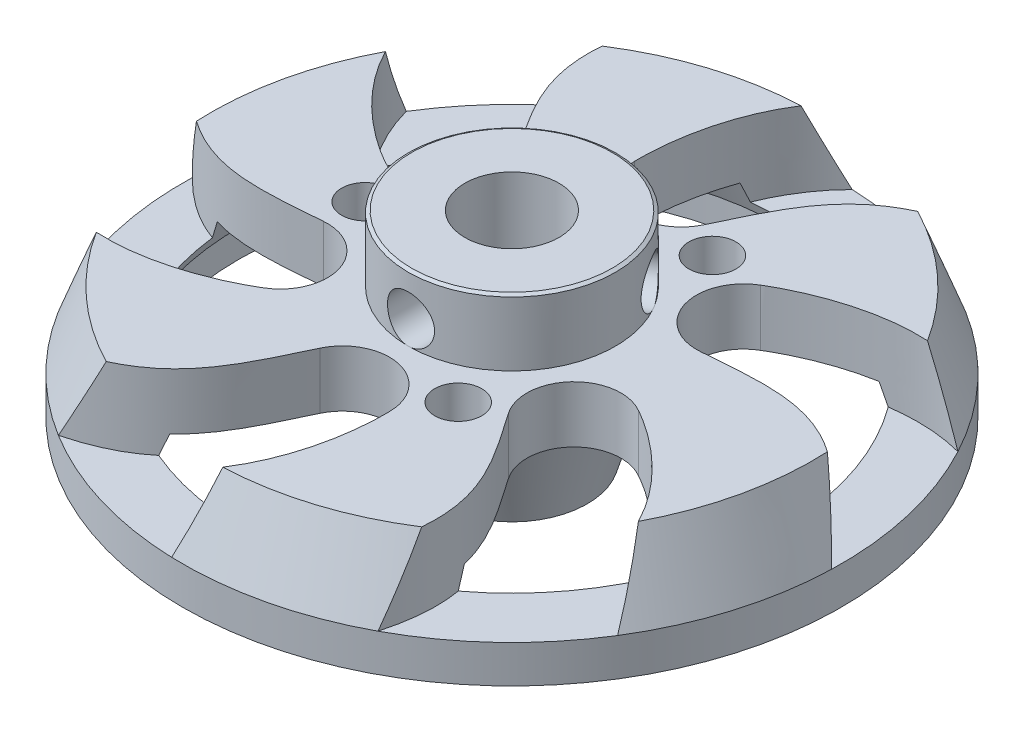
ISO-10303-21;
HEADER;
FILE_DESCRIPTION(('STEP AP214'),'2;1');
FILE_NAME('part.step','',(''),(''),'','','');
FILE_SCHEMA(('AUTOMOTIVE_DESIGN { 1 0 10303 214 1 1 1 1 }'));
ENDSEC;
DATA;
#1=APPLICATION_CONTEXT('core data for automotive mechanical design processes');
#2=APPLICATION_PROTOCOL_DEFINITION('international standard','automotive_design',2000,#1);
#3=PRODUCT_CONTEXT('',#1,'mechanical');
#4=PRODUCT('Part','Part','',(#3));
#5=PRODUCT_RELATED_PRODUCT_CATEGORY('part','',(#4));
#6=PRODUCT_DEFINITION_FORMATION('','',#4);
#7=PRODUCT_DEFINITION_CONTEXT('part definition',#1,'design');
#8=PRODUCT_DEFINITION('design','',#6,#7);
#9=PRODUCT_DEFINITION_SHAPE('','',#8);
#10=(LENGTH_UNIT() NAMED_UNIT(*) SI_UNIT(.MILLI.,.METRE.));
#11=(NAMED_UNIT(*) PLANE_ANGLE_UNIT() SI_UNIT($,.RADIAN.));
#12=(NAMED_UNIT(*) SI_UNIT($,.STERADIAN.) SOLID_ANGLE_UNIT());
#13=UNCERTAINTY_MEASURE_WITH_UNIT(LENGTH_MEASURE(1.E-05),#10,'distance_accuracy_value','');
#14=(GEOMETRIC_REPRESENTATION_CONTEXT(3) GLOBAL_UNCERTAINTY_ASSIGNED_CONTEXT((#13)) GLOBAL_UNIT_ASSIGNED_CONTEXT((#10,
#11,#12)) REPRESENTATION_CONTEXT('',''));
#15=CARTESIAN_POINT('',(0.,0.,0.));
#16=DIRECTION('',(0.,0.,1.));
#17=DIRECTION('',(1.,0.,0.));
#18=AXIS2_PLACEMENT_3D('',#15,#16,#17);
#19=CARTESIAN_POINT('',(0.,9.5,0.));
#20=DIRECTION('',(0.,-1.,0.));
#21=DIRECTION('',(0.,0.,-1.));
#22=AXIS2_PLACEMENT_3D('',#19,#20,#21);
#23=CYLINDRICAL_SURFACE('',#22,5.5);
#24=CARTESIAN_POINT('',(0.,9.4,0.));
#25=DIRECTION('',(0.,1.,0.));
#26=DIRECTION('',(0.,0.,1.));
#27=AXIS2_PLACEMENT_3D('',#24,#25,#26);
#28=CIRCLE('',#27,5.5);
#29=CARTESIAN_POINT('',(0.,9.4,5.5));
#30=VERTEX_POINT('',#29);
#31=EDGE_CURVE('E327',#30,#30,#28,.F.);
#32=ORIENTED_EDGE('',*,*,#31,.T.);
#33=EDGE_LOOP('',(#32));
#34=FACE_BOUND('',#33,.T.);
#35=CARTESIAN_POINT('',(0.,6.,0.));
#36=DIRECTION('',(0.,1.,0.));
#37=DIRECTION('',(0.,0.,1.));
#38=AXIS2_PLACEMENT_3D('',#35,#36,#37);
#39=CIRCLE('',#38,5.5);
#40=CARTESIAN_POINT('',(0.,6.,5.5));
#41=VERTEX_POINT('',#40);
#42=CARTESIAN_POINT('',(4.76313972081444,6.,-2.74999999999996));
#43=VERTEX_POINT('',#42);
#44=EDGE_CURVE('E652',#41,#43,#39,.T.);
#45=ORIENTED_EDGE('',*,*,#44,.T.);
#46=CARTESIAN_POINT('',(4.76313972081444,6.,-2.74999999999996));
#47=CARTESIAN_POINT('',(4.72850905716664,6.00000226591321,-2.80997954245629));
#48=CARTESIAN_POINT('',(4.69272276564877,6.00577561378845,-2.8693228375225));
#49=CARTESIAN_POINT('',(4.61997275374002,6.02868973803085,-2.98505178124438));
#50=CARTESIAN_POINT('',(4.5830082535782,6.04583819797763,-3.04143540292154));
#51=CARTESIAN_POINT('',(4.50926642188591,6.09093402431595,-3.14973098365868));
#52=CARTESIAN_POINT('',(4.47248893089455,6.11886966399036,-3.20164772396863));
#53=CARTESIAN_POINT('',(4.40048061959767,6.18470855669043,-3.29992219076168));
#54=CARTESIAN_POINT('',(4.36524978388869,6.22261171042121,-3.3462799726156));
#55=CARTESIAN_POINT('',(4.29722735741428,6.30800102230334,-3.43321046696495));
#56=CARTESIAN_POINT('',(4.26448190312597,6.3556262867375,-3.47368265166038));
#57=CARTESIAN_POINT('',(4.20349257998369,6.45880948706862,-3.54724379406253));
#58=CARTESIAN_POINT('',(4.17524913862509,6.51436817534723,-3.58033205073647));
#59=CARTESIAN_POINT('',(4.12431151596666,6.63266602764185,-3.63889874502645));
#60=CARTESIAN_POINT('',(4.10168814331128,6.69548349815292,-3.66428089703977));
#61=CARTESIAN_POINT('',(4.06364984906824,6.82600475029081,-3.70642161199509));
#62=CARTESIAN_POINT('',(4.04823399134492,6.89370789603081,-3.72318129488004));
#63=CARTESIAN_POINT('',(4.02568820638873,7.03087959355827,-3.74754693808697));
#64=CARTESIAN_POINT('',(4.01842391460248,7.10029963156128,-3.75530141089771));
#65=CARTESIAN_POINT('',(4.01215084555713,7.23992911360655,-3.76200322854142));
#66=CARTESIAN_POINT('',(4.01314096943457,7.31013845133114,-3.76095174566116));
#67=CARTESIAN_POINT('',(4.02321276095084,7.44788644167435,-3.75017459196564));
#68=CARTESIAN_POINT('',(4.03213414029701,7.51545045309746,-3.7406207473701));
#69=CARTESIAN_POINT('',(4.05734564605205,7.64745724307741,-3.71325856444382));
#70=CARTESIAN_POINT('',(4.0736362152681,7.71189983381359,-3.69544973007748));
#71=CARTESIAN_POINT('',(4.11289127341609,7.83647033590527,-3.65171078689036));
#72=CARTESIAN_POINT('',(4.13591149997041,7.89655675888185,-3.62571270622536));
#73=CARTESIAN_POINT('',(4.18742816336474,8.01025127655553,-3.5660893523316));
#74=CARTESIAN_POINT('',(4.21592540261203,8.06385842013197,-3.53246296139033));
#75=CARTESIAN_POINT('',(4.27781117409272,8.16438928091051,-3.45727523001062));
#76=CARTESIAN_POINT('',(4.31129857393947,8.21112721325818,-3.41554659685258));
#77=CARTESIAN_POINT('',(4.38115771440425,8.29510294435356,-3.32546250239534));
#78=CARTESIAN_POINT('',(4.41752951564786,8.33234054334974,-3.27710690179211));
#79=CARTESIAN_POINT('',(4.49173218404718,8.39631019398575,-3.17464138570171));
#80=CARTESIAN_POINT('',(4.52956639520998,8.42301638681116,-3.12051771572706));
#81=CARTESIAN_POINT('',(4.60511179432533,8.46494200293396,-3.00791229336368));
#82=CARTESIAN_POINT('',(4.64282300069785,8.48016323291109,-2.94943122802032));
#83=CARTESIAN_POINT('',(4.71596149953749,8.49841311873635,-2.83098008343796));
#84=CARTESIAN_POINT('',(4.75142037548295,8.50169534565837,-2.77106851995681));
#85=CARTESIAN_POINT('',(4.8198218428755,8.49666348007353,-2.6503079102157));
#86=CARTESIAN_POINT('',(4.85276461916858,8.48835024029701,-2.58945893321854));
#87=CARTESIAN_POINT('',(4.91494222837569,8.46057341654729,-2.46938515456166));
#88=CARTESIAN_POINT('',(4.94421665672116,8.44124422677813,-2.41014963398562));
#89=CARTESIAN_POINT('',(4.99901241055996,8.39213448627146,-2.29433713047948));
#90=CARTESIAN_POINT('',(5.02453339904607,8.36235299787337,-2.23776038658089));
#91=CARTESIAN_POINT('',(5.07193903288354,8.29266542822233,-2.12815822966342));
#92=CARTESIAN_POINT('',(5.09376243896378,8.25261218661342,-2.07519995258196));
#93=CARTESIAN_POINT('',(5.13326191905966,8.1637103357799,-1.97547564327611));
#94=CARTESIAN_POINT('',(5.15093740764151,8.11486048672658,-1.928710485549));
#95=CARTESIAN_POINT('',(5.18256463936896,8.00858451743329,-1.84206350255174));
#96=CARTESIAN_POINT('',(5.19643481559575,7.95100637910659,-1.80233809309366));
#97=CARTESIAN_POINT('',(5.22016439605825,7.82957680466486,-1.7324123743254));
#98=CARTESIAN_POINT('',(5.23002397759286,7.76572564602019,-1.70221164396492));
#99=CARTESIAN_POINT('',(5.2458826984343,7.63390976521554,-1.6526921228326));
#100=CARTESIAN_POINT('',(5.25190411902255,7.56597133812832,-1.63331060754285));
#101=CARTESIAN_POINT('',(5.26032137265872,7.42761654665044,-1.60599722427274));
#102=CARTESIAN_POINT('',(5.2627178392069,7.3572006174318,-1.59806335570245));
#103=CARTESIAN_POINT('',(5.26393588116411,7.21767069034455,-1.59404590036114));
#104=CARTESIAN_POINT('',(5.26284051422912,7.1485652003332,-1.59768698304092));
#105=CARTESIAN_POINT('',(5.25722772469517,7.01199054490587,-1.6160591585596));
#106=CARTESIAN_POINT('',(5.25271034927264,6.94452135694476,-1.63079009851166));
#107=CARTESIAN_POINT('',(5.24017090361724,6.81337830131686,-1.67064035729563));
#108=CARTESIAN_POINT('',(5.23216311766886,6.74969015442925,-1.69571731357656));
#109=CARTESIAN_POINT('',(5.21248183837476,6.6274926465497,-1.75528134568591));
#110=CARTESIAN_POINT('',(5.20080792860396,6.56898387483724,-1.78976949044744));
#111=CARTESIAN_POINT('',(5.17331542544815,6.45743278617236,-1.86776591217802));
#112=CARTESIAN_POINT('',(5.15741216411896,6.40453713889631,-1.91145415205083));
#113=CARTESIAN_POINT('',(5.12142811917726,6.30708840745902,-2.00587177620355));
#114=CARTESIAN_POINT('',(5.10134636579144,6.26253726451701,-2.05660279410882));
#115=CARTESIAN_POINT('',(5.05664641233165,6.18243096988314,-2.16420083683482));
#116=CARTESIAN_POINT('',(5.03196763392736,6.14701308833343,-2.22114501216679));
#117=CARTESIAN_POINT('',(4.97843546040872,6.08710001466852,-2.33866089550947));
#118=CARTESIAN_POINT('',(4.94958546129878,6.06259600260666,-2.3992296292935));
#119=CARTESIAN_POINT('',(4.89494564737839,6.02938604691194,-2.50846138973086));
#120=CARTESIAN_POINT('',(4.86988378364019,6.01838800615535,-2.55680471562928));
#121=CARTESIAN_POINT('',(4.81784128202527,6.00369426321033,-2.6535679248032));
#122=CARTESIAN_POINT('',(4.79086074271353,5.99999818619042,-2.70198780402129));
#123=CARTESIAN_POINT('',(4.76313972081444,6.,-2.74999999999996));
#124=B_SPLINE_CURVE_WITH_KNOTS('',3,(#46,#47,#48,#49,#50,#51,#52,#53,#54,#55,#56,#57,#58,#59,
#60,#61,#62,#63,#64,#65,#66,#67,#68,#69,#70,#71,#72,#73,#74,#75,#76,#77,#78,#79,#80,#81,#82,#83,
#84,#85,#86,#87,#88,#89,#90,#91,#92,#93,#94,#95,#96,#97,#98,#99,#100,#101,#102,#103,#104,#105,
#106,#107,#108,#109,#110,#111,#112,#113,#114,#115,#116,#117,#118,#119,#120,#121,#122,#123),
.UNSPECIFIED.,.T.,.F.,(4,2,2,2,2,2,2,2,2,2,2,2,2,2,2,2,2,2,2,2,2,2,2,2,2,2,2,2,2,2,2,2,2,2,2,2,
2,2,4),(0.,0.207574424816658,0.415289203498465,0.622778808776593,0.830266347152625,
1.04096194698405,1.25167754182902,1.46492681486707,1.6781483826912,1.88780122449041,
2.09742615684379,2.30290857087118,2.50840333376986,2.71565078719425,2.92292862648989,
3.13505765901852,3.34719115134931,3.55984232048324,3.77246003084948,3.98053470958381,
4.18859408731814,4.39416788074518,4.59976012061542,4.80848064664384,5.01723061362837,
5.23015660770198,5.44307318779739,5.65474220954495,5.86637423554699,6.07301021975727,
6.27964335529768,6.48543868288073,6.69125739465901,6.90155512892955,7.11190172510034,
7.32524638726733,7.53841832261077,7.70458523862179,7.87074362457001),.UNSPECIFIED.);
#125=EDGE_CURVE('E50',#43,#43,#124,.T.);
#126=ORIENTED_EDGE('',*,*,#125,.F.);
#127=EDGE_CURVE('E56',#43,#41,#39,.T.);
#128=ORIENTED_EDGE('',*,*,#127,.T.);
#129=CARTESIAN_POINT('',(0.,6.,5.5));
#130=CARTESIAN_POINT('',(0.0692591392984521,6.00000226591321,5.49999873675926));
#131=CARTESIAN_POINT('',(0.138545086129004,6.00577561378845,5.49867854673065));
#132=CARTESIAN_POINT('',(0.275144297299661,6.02868973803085,5.493539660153));
#133=CARTESIAN_POINT('',(0.342456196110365,6.04583819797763,5.48971927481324));
#134=CARTESIAN_POINT('',(0.473113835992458,6.09093402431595,5.48000476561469));
#135=CARTESIAN_POINT('',(0.536463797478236,6.11886966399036,5.47411289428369));
#136=CARTESIAN_POINT('',(0.657576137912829,6.18470855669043,5.46088910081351));
#137=CARTESIAN_POINT('',(0.71533857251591,6.2226117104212,5.45355719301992));
#138=CARTESIAN_POINT('',(0.824633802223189,6.30800102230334,5.4381132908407));
#139=CARTESIAN_POINT('',(0.876056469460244,6.3556262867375,5.42999098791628));
#140=CARTESIAN_POINT('',(0.970256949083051,6.45880948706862,5.41395325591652));
#141=CARTESIAN_POINT('',(1.01303394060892,6.51436817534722,5.40603784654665));
#142=CARTESIAN_POINT('',(1.08922299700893,6.63266602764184,5.39120791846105));
#143=CARTESIAN_POINT('',(1.12251627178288,6.69548349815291,5.38430657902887));
#144=CARTESIAN_POINT('',(1.17803034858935,6.82600475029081,5.37243480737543));
#145=CARTESIAN_POINT('',(1.20025258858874,6.89370789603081,5.36746412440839));
#146=CARTESIAN_POINT('',(1.23262674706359,7.03087959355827,5.36012172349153));
#147=CARTESIAN_POINT('',(1.24297446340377,7.10029963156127,5.3577078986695));
#148=CARTESIAN_POINT('',(1.25191494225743,7.23992911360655,5.35562617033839));
#149=CARTESIAN_POINT('',(1.25050926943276,7.31013845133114,5.35595790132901));
#150=CARTESIAN_POINT('',(1.23614008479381,7.44788644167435,5.35929175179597));
#151=CARTESIAN_POINT('',(1.22340552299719,7.51545045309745,5.36224097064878));
#152=CARTESIAN_POINT('',(1.18710342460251,7.64745724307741,5.37039368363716));
#153=CARTESIAN_POINT('',(1.16353523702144,7.71189983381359,5.3755973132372));
#154=CARTESIAN_POINT('',(1.10602867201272,7.83647033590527,5.38772371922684));
#155=CARTESIAN_POINT('',(1.07200356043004,7.89655675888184,5.39466077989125));
#156=CARTESIAN_POINT('',(0.99460988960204,8.01025127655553,5.40946384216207));
#157=CARTESIAN_POINT('',(0.951239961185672,8.06385842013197,5.41732997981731));
#158=CARTESIAN_POINT('',(0.855182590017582,8.16438928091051,5.43333076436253));
#159=CARTESIAN_POINT('',(0.802300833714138,8.21112721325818,5.44146738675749));
#160=CARTESIAN_POINT('',(0.689356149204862,8.29510294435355,5.45692512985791));
#161=CARTESIAN_POINT('',(0.629293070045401,8.33234054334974,5.46424623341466));
#162=CARTESIAN_POINT('',(0.503453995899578,8.39631019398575,5.47727487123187));
#163=CARTESIAN_POINT('',(0.43766441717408,8.42301638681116,5.48297842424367));
#164=CARTESIAN_POINT('',(0.30237256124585,8.46494200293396,5.49209994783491));
#165=CARTESIAN_POINT('',(0.232870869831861,8.48016323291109,5.49551827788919));
#166=CARTESIAN_POINT('',(0.093719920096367,8.49841311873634,5.4996325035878));
#167=CARTESIAN_POINT('',(0.0241055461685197,8.50169534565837,5.50038500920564));
#168=CARTESIAN_POINT('',(-0.114676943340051,8.49666348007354,5.49924211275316));
#169=CARTESIAN_POINT('',(-0.183845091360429,8.48835024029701,5.49734690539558));
#170=CARTESIAN_POINT('',(-0.318920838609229,8.46057341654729,5.49115740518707));
#171=CARTESIAN_POINT('',(-0.384857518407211,8.44124422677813,5.4868920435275));
#172=CARTESIAN_POINT('',(-0.512551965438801,8.39213448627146,5.47644030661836));
#173=CARTESIAN_POINT('',(-0.574309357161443,8.36235299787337,5.47025375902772));
#174=CARTESIAN_POINT('',(-0.69293042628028,8.29266542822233,5.45650716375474));
#175=CARTESIAN_POINT('',(-0.749705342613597,8.25261218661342,5.4489276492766));
#176=CARTESIAN_POINT('',(-0.855818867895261,8.1637103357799,5.43327304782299));
#177=CARTESIAN_POINT('',(-0.905156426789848,8.11486048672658,5.42519789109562));
#178=CARTESIAN_POINT('',(-0.996008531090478,8.00858451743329,5.40926438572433));
#179=CARTESIAN_POINT('',(-1.03734683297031,7.95100637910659,5.40141360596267));
#180=CARTESIAN_POINT('',(-1.10976907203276,7.82957680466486,5.3870011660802));
#181=CARTESIAN_POINT('',(-1.14085346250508,7.76572564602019,5.38043944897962));
#182=CARTESIAN_POINT('',(-1.19166798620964,7.63390976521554,5.36941374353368));
#183=CARTESIAN_POINT('',(-1.21146358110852,7.56597133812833,5.3649376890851));
#184=CARTESIAN_POINT('',(-1.23932629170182,7.42761654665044,5.35857055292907));
#185=CARTESIAN_POINT('',(-1.24739545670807,7.3572006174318,5.35667901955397));
#186=CARTESIAN_POINT('',(-1.25148369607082,7.21767069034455,5.35572514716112));
#187=CARTESIAN_POINT('',(-1.24778274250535,7.1485652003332,5.35659707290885));
#188=CARTESIAN_POINT('',(-1.22906557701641,7.01199054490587,5.36092234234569));
#189=CARTESIAN_POINT('',(-1.21404952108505,6.94452135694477,5.36437565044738));
#190=CARTESIAN_POINT('',(-1.17326846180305,6.81337830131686,5.37344130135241));
#191=CARTESIAN_POINT('',(-1.14754728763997,6.74969015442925,5.37904483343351));
#192=CARTESIAN_POINT('',(-1.0861226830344,6.6274926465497,5.39178236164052));
#193=CARTESIAN_POINT('',(-1.05041811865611,6.56898387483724,5.39891653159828));
#194=CARTESIAN_POINT('',(-0.969124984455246,6.45743278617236,5.41410553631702));
#195=CARTESIAN_POINT('',(-0.92333822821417,6.40453713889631,5.42217702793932));
#196=CARTESIAN_POINT('',(-0.823578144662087,6.30708840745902,5.43822274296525));
#197=CARTESIAN_POINT('',(-0.769602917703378,6.26253726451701,5.44619694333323));
#198=CARTESIAN_POINT('',(-0.654070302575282,6.18243096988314,5.46128466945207));
#199=CARTESIAN_POINT('',(-0.592415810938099,6.14701308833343,5.46838430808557));
#200=CARTESIAN_POINT('',(-0.463877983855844,6.08710001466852,5.48078202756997));
#201=CARTESIAN_POINT('',(-0.396998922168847,6.06259600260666,5.48608156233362));
#202=CARTESIAN_POINT('',(-0.275081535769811,6.02938604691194,5.49337797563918));
#203=CARTESIAN_POINT('',(-0.220684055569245,6.01838800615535,5.49584542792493));
#204=CARTESIAN_POINT('',(-0.110863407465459,6.00369426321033,5.49915690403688));
#205=CARTESIAN_POINT('',(-0.0554402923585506,5.99999818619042,5.50000101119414));
#206=CARTESIAN_POINT('',(0.,6.,5.5));
#207=B_SPLINE_CURVE_WITH_KNOTS('',3,(#129,#130,#131,#132,#133,#134,#135,#136,#137,#138,#139,
#140,#141,#142,#143,#144,#145,#146,#147,#148,#149,#150,#151,#152,#153,#154,#155,#156,#157,#158,
#159,#160,#161,#162,#163,#164,#165,#166,#167,#168,#169,#170,#171,#172,#173,#174,#175,#176,#177,
#178,#179,#180,#181,#182,#183,#184,#185,#186,#187,#188,#189,#190,#191,#192,#193,#194,#195,#196,
#197,#198,#199,#200,#201,#202,#203,#204,#205,#206),.UNSPECIFIED.,.T.,.F.,(4,2,2,2,2,2,2,2,2,2,2,
2,2,2,2,2,2,2,2,2,2,2,2,2,2,2,2,2,2,2,2,2,2,2,2,2,2,2,4),(0.,0.207574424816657,
0.415289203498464,0.622778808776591,0.830266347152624,1.04096194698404,1.25167754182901,
1.46492681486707,1.67814838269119,1.88780122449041,2.09742615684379,2.30290857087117,
2.50840333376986,2.71565078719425,2.92292862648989,3.13505765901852,3.34719115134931,
3.55984232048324,3.77246003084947,3.98053470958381,4.18859408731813,4.39416788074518,
4.59976012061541,4.80848064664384,5.01723061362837,5.23015660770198,5.44307318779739,
5.65474220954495,5.86637423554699,6.07301021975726,6.27964335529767,6.48543868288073,
6.69125739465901,6.90155512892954,7.11190172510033,7.32524638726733,7.53841832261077,
7.70458523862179,7.87074362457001),.UNSPECIFIED.);
#208=EDGE_CURVE('E947',#41,#41,#207,.T.);
#209=ORIENTED_EDGE('',*,*,#208,.F.);
#210=EDGE_LOOP('',(#45,#126,#128,#209));
#211=FACE_BOUND('',#210,.T.);
#212=ADVANCED_FACE('F32',(#34,#211),#23,.T.);
#213=CARTESIAN_POINT('',(0.,-2.,0.));
#214=DIRECTION('',(0.,1.,0.));
#215=DIRECTION('',(0.,0.,1.));
#216=AXIS2_PLACEMENT_3D('',#213,#214,#215);
#217=CYLINDRICAL_SURFACE('',#216,2.5);
#218=CARTESIAN_POINT('',(0.,6.,2.5));
#219=CARTESIAN_POINT('',(-0.0657149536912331,6.00000412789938,2.49999641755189));
#220=CARTESIAN_POINT('',(-0.131508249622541,6.00521259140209,2.49738113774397));
#221=CARTESIAN_POINT('',(-0.261150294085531,6.02581610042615,2.48717695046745));
#222=CARTESIAN_POINT('',(-0.32499510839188,6.04123049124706,2.47957859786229));
#223=CARTESIAN_POINT('',(-0.448666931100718,6.08149226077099,2.46020349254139));
#224=CARTESIAN_POINT('',(-0.508508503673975,6.10630298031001,2.448442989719));
#225=CARTESIAN_POINT('',(-0.623090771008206,6.16446327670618,2.42182220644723));
#226=CARTESIAN_POINT('',(-0.677831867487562,6.19781218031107,2.40696217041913));
#227=CARTESIAN_POINT('',(-0.784384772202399,6.27439656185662,2.37445322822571));
#228=CARTESIAN_POINT('',(-0.83581901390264,6.31810809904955,2.3566899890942));
#229=CARTESIAN_POINT('',(-0.930974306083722,6.41315184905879,2.3207496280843));
#230=CARTESIAN_POINT('',(-0.974689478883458,6.46448981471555,2.30257220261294));
#231=CARTESIAN_POINT('',(-1.05656500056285,6.57810418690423,2.26623688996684));
#232=CARTESIAN_POINT('',(-1.09403166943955,6.64092012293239,2.24818983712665));
#233=CARTESIAN_POINT('',(-1.15771028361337,6.77295916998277,2.21607473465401));
#234=CARTESIAN_POINT('',(-1.18393026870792,6.84217766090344,2.20200384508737));
#235=CARTESIAN_POINT('',(-1.22266555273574,6.9808313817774,2.18072333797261));
#236=CARTESIAN_POINT('',(-1.23590732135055,7.05000556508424,2.17315339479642));
#237=CARTESIAN_POINT('',(-1.25053374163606,7.18997354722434,2.1647736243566));
#238=CARTESIAN_POINT('',(-1.25193011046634,7.26076567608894,2.1639571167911));
#239=CARTESIAN_POINT('',(-1.24335910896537,7.39285753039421,2.16888662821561));
#240=CARTESIAN_POINT('',(-1.23473069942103,7.45428003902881,2.17385954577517));
#241=CARTESIAN_POINT('',(-1.20867481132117,7.5746523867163,2.18845285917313));
#242=CARTESIAN_POINT('',(-1.19124452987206,7.63360143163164,2.1980747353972));
#243=CARTESIAN_POINT('',(-1.1477622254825,7.74903641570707,2.22109345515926));
#244=CARTESIAN_POINT('',(-1.12151883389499,7.80543299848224,2.23457300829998));
#245=CARTESIAN_POINT('',(-1.061302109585,7.91329286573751,2.26379255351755));
#246=CARTESIAN_POINT('',(-1.02732530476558,7.96475391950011,2.27953355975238));
#247=CARTESIAN_POINT('',(-0.947582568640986,8.06815156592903,2.31391447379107));
#248=CARTESIAN_POINT('',(-0.900868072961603,8.1193210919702,2.33266887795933));
#249=CARTESIAN_POINT('',(-0.799444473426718,8.21341927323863,2.36934529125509));
#250=CARTESIAN_POINT('',(-0.744731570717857,8.25634399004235,2.38726689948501));
#251=CARTESIAN_POINT('',(-0.62564563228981,8.33460707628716,2.42127484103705));
#252=CARTESIAN_POINT('',(-0.56094198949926,8.36950059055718,2.43723730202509));
#253=CARTESIAN_POINT('',(-0.425582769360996,8.42762128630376,2.46447351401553));
#254=CARTESIAN_POINT('',(-0.354931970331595,8.45085773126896,2.47575098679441));
#255=CARTESIAN_POINT('',(-0.215958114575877,8.48309425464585,2.49155417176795));
#256=CARTESIAN_POINT('',(-0.147926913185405,8.49311404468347,2.4965617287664));
#257=CARTESIAN_POINT('',(-0.0109744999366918,8.50183091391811,2.50091266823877));
#258=CARTESIAN_POINT('',(0.0579462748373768,8.50053335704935,2.5002587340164));
#259=CARTESIAN_POINT('',(0.189041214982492,8.48724163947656,2.49363990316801));
#260=CARTESIAN_POINT('',(0.251324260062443,8.47608433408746,2.48809057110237));
#261=CARTESIAN_POINT('',(0.373008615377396,8.44470241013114,2.47277714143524));
#262=CARTESIAN_POINT('',(0.432409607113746,8.4244767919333,2.46301257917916));
#263=CARTESIAN_POINT('',(0.548610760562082,8.37500191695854,2.43980314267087));
#264=CARTESIAN_POINT('',(0.605287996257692,8.34551118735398,2.42626102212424));
#265=CARTESIAN_POINT('',(0.713076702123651,8.27861558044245,2.39679967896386));
#266=CARTESIAN_POINT('',(0.764185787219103,8.24120733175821,2.38087944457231));
#267=CARTESIAN_POINT('',(0.864709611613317,8.15529946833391,2.3463527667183));
#268=CARTESIAN_POINT('',(0.913465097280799,8.10607141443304,2.32763606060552));
#269=CARTESIAN_POINT('',(1.00232040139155,8.00009356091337,2.29077989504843));
#270=CARTESIAN_POINT('',(1.04241423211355,7.94333860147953,2.27264084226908));
#271=CARTESIAN_POINT('',(1.11463489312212,7.82044543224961,2.23813990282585));
#272=CARTESIAN_POINT('',(1.1462818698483,7.75398591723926,2.2219066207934));
#273=CARTESIAN_POINT('',(1.19760353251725,7.61561241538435,2.19467590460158));
#274=CARTESIAN_POINT('',(1.21729364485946,7.54370559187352,2.18367172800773));
#275=CARTESIAN_POINT('',(1.2423271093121,7.40386222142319,2.16951876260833));
#276=CARTESIAN_POINT('',(1.24886624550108,7.33620718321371,2.16571729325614));
#277=CARTESIAN_POINT('',(1.25086144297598,7.20069116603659,2.16456693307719));
#278=CARTESIAN_POINT('',(1.2463223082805,7.13283028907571,2.16721524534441));
#279=CARTESIAN_POINT('',(1.22740765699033,7.00564562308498,2.17797327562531));
#280=CARTESIAN_POINT('',(1.2140103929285,6.9461244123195,2.18553868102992));
#281=CARTESIAN_POINT('',(1.17896919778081,6.83023985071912,2.20463770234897));
#282=CARTESIAN_POINT('',(1.15732261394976,6.77387752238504,2.21617259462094));
#283=CARTESIAN_POINT('',(1.10476968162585,6.66171893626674,2.2428566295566));
#284=CARTESIAN_POINT('',(1.07333892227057,6.60621512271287,2.25819652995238));
#285=CARTESIAN_POINT('',(1.00268871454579,6.50090682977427,2.29044164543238));
#286=CARTESIAN_POINT('',(0.96346521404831,6.45110533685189,2.30734767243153));
#287=CARTESIAN_POINT('',(0.872754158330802,6.35232252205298,2.34327903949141));
#288=CARTESIAN_POINT('',(0.820355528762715,6.3041761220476,2.36231229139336));
#289=CARTESIAN_POINT('',(0.70769350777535,6.21717127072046,2.3984719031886));
#290=CARTESIAN_POINT('',(0.647425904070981,6.17831782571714,2.4155972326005));
#291=CARTESIAN_POINT('',(0.519914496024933,6.11095454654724,2.44622511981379));
#292=CARTESIAN_POINT('',(0.452624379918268,6.08251978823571,2.45970120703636));
#293=CARTESIAN_POINT('',(0.313427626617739,6.03773979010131,2.48126676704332));
#294=CARTESIAN_POINT('',(0.241534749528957,6.02136019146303,2.48937154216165));
#295=CARTESIAN_POINT('',(0.140752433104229,6.00762823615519,2.49619327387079));
#296=CARTESIAN_POINT('',(0.112702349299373,6.00477169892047,2.49761706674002));
#297=CARTESIAN_POINT('',(0.0564396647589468,6.00095666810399,2.49952121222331));
#298=CARTESIAN_POINT('',(0.0282270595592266,5.999998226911,2.50000153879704));
#299=CARTESIAN_POINT('',(0.,6.,2.5));
#300=B_SPLINE_CURVE_WITH_KNOTS('',3,(#218,#219,#220,#221,#222,#223,#224,#225,#226,#227,#228,
#229,#230,#231,#232,#233,#234,#235,#236,#237,#238,#239,#240,#241,#242,#243,#244,#245,#246,#247,
#248,#249,#250,#251,#252,#253,#254,#255,#256,#257,#258,#259,#260,#261,#262,#263,#264,#265,#266,
#267,#268,#269,#270,#271,#272,#273,#274,#275,#276,#277,#278,#279,#280,#281,#282,#283,#284,#285,
#286,#287,#288,#289,#290,#291,#292,#293,#294,#295,#296,#297,#298,#299),.UNSPECIFIED.,.T.,.F.,(4,
2,2,2,2,2,2,2,2,2,2,2,2,2,2,2,2,2,2,2,2,2,2,2,2,2,2,2,2,2,2,2,2,2,2,2,2,2,2,2,4),(0.,
0.197030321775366,0.394435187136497,0.591077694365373,0.78770470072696,0.996227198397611,
1.20490779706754,1.42977158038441,1.65447434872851,1.86572515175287,2.07676696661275,
2.26257140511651,2.44843504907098,2.63862800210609,2.82890651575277,3.04331176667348,
3.25781918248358,3.48228777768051,3.7065777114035,3.91229113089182,4.11790705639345,
4.30758633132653,4.49728652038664,4.69241070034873,4.88761813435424,5.10199513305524,
5.3165198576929,5.54143352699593,5.76605639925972,5.96911634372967,6.17208824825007,
6.35572412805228,6.53941910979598,6.73545570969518,6.93159451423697,7.15156553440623,
7.37165479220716,7.59330017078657,7.81431135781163,7.89894100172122,7.98357298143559),.UNSPECIFIED.);
#301=CARTESIAN_POINT('',(0.,6.,2.5));
#302=VERTEX_POINT('',#301);
#303=EDGE_CURVE('E973',#302,#302,#300,.T.);
#304=ORIENTED_EDGE('',*,*,#303,.F.);
#305=EDGE_LOOP('',(#304));
#306=FACE_BOUND('',#305,.T.);
#307=CARTESIAN_POINT('',(0.,-2.,0.));
#308=DIRECTION('',(0.,1.,0.));
#309=DIRECTION('',(0.,0.,1.));
#310=AXIS2_PLACEMENT_3D('',#307,#308,#309);
#311=CIRCLE('',#310,2.5);
#312=CARTESIAN_POINT('',(0.,-2.,2.5));
#313=VERTEX_POINT('',#312);
#314=EDGE_CURVE('E1448',#313,#313,#311,.T.);
#315=ORIENTED_EDGE('',*,*,#314,.F.);
#316=EDGE_LOOP('',(#315));
#317=FACE_BOUND('',#316,.T.);
#318=CARTESIAN_POINT('',(0.,9.5,0.));
#319=DIRECTION('',(0.,1.,0.));
#320=DIRECTION('',(0.,0.,1.));
#321=AXIS2_PLACEMENT_3D('',#318,#319,#320);
#322=CIRCLE('',#321,2.5);
#323=CARTESIAN_POINT('',(0.,9.5,2.5));
#324=VERTEX_POINT('',#323);
#325=EDGE_CURVE('E1355',#324,#324,#322,.T.);
#326=ORIENTED_EDGE('',*,*,#325,.T.);
#327=EDGE_LOOP('',(#326));
#328=FACE_BOUND('',#327,.T.);
#329=CARTESIAN_POINT('',(2.5,7.25,0.));
#330=CARTESIAN_POINT('',(2.50000264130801,7.31513476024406,-6.7744096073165E-06));
#331=CARTESIAN_POINT('',(2.50002170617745,7.38035176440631,-0.00593041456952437));
#332=CARTESIAN_POINT('',(2.49985499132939,7.50878408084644,-0.0291833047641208));
#333=CARTESIAN_POINT('',(2.49966878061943,7.57199489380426,-0.0465365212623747));
#334=CARTESIAN_POINT('',(2.49843027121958,7.69431458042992,-0.0913254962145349));
#335=CARTESIAN_POINT('',(2.49738254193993,7.75344331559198,-0.118707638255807));
#336=CARTESIAN_POINT('',(2.4935612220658,7.8667802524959,-0.182091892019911));
#337=CARTESIAN_POINT('',(2.49078753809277,7.92098818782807,-0.218094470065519));
#338=CARTESIAN_POINT('',(2.48224112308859,8.02788216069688,-0.300553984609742));
#339=CARTESIAN_POINT('',(2.47623990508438,8.08007391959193,-0.347628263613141));
#340=CARTESIAN_POINT('',(2.45997016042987,8.17676048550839,-0.448506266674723));
#341=CARTESIAN_POINT('',(2.44969951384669,8.2212514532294,-0.502313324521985));
#342=CARTESIAN_POINT('',(2.42299463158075,8.30420893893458,-0.618787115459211));
#343=CARTESIAN_POINT('',(2.4061915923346,8.34206720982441,-0.681806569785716));
#344=CARTESIAN_POINT('',(2.36565742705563,8.4064260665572,-0.811330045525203));
#345=CARTESIAN_POINT('',(2.3419306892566,8.43293382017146,-0.877831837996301));
#346=CARTESIAN_POINT('',(2.2892222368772,8.47188082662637,-1.00696230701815));
#347=CARTESIAN_POINT('',(2.26073456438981,8.48518690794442,-1.06952987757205));
#348=CARTESIAN_POINT('',(2.19800224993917,8.5002076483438,-1.19313802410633));
#349=CARTESIAN_POINT('',(2.1637611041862,8.50192932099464,-1.25417950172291));
#350=CARTESIAN_POINT('',(2.09385238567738,8.49406665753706,-1.36741583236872));
#351=CARTESIAN_POINT('',(2.05856779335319,8.48545248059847,-1.41991838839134));
#352=CARTESIAN_POINT('',(1.98539309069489,8.45889894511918,-1.52055442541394));
#353=CARTESIAN_POINT('',(1.94750278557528,8.44095888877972,-1.56868757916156));
#354=CARTESIAN_POINT('',(1.87001124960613,8.39614679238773,-1.66033508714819));
#355=CARTESIAN_POINT('',(1.83039360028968,8.36915460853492,-1.70377632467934));
#356=CARTESIAN_POINT('',(1.75146072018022,8.30717072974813,-1.78482219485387));
#357=CARTESIAN_POINT('',(1.71214560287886,8.27217617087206,-1.82242472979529));
#358=CARTESIAN_POINT('',(1.6316919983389,8.19138081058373,-1.89493641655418));
#359=CARTESIAN_POINT('',(1.59073245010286,8.14487121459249,-1.92925497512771));
#360=CARTESIAN_POINT('',(1.51296157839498,8.04426284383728,-1.9908321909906));
#361=CARTESIAN_POINT('',(1.47615345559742,7.99015828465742,-2.01808542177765));
#362=CARTESIAN_POINT('',(1.40667685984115,7.87168975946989,-2.06716811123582));
#363=CARTESIAN_POINT('',(1.37441970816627,7.80689247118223,-2.08854323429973));
#364=CARTESIAN_POINT('',(1.31974581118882,7.67132791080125,-2.12351945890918));
#365=CARTESIAN_POINT('',(1.29731880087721,7.60056695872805,-2.13712867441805));
#366=CARTESIAN_POINT('',(1.26601828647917,7.46098186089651,-2.15580789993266));
#367=CARTESIAN_POINT('',(1.25621156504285,7.39244860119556,-2.16146914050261));
#368=CARTESIAN_POINT('',(1.24810835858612,7.25449832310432,-2.1661608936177));
#369=CARTESIAN_POINT('',(1.24980374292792,7.18508196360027,-2.1651960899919));
#370=CARTESIAN_POINT('',(1.26366436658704,7.05543260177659,-2.15712752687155));
#371=CARTESIAN_POINT('',(1.27466401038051,6.99502568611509,-2.15070685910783));
#372=CARTESIAN_POINT('',(1.30463339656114,6.8770402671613,-2.13265921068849));
#373=CARTESIAN_POINT('',(1.32360571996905,6.81946268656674,-2.12103054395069));
#374=CARTESIAN_POINT('',(1.3691815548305,6.70573583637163,-2.09191353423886));
#375=CARTESIAN_POINT('',(1.39609780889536,6.64977622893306,-2.07417874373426));
#376=CARTESIAN_POINT('',(1.45546842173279,6.54316341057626,-2.03295773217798));
#377=CARTESIAN_POINT('',(1.48792562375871,6.4925129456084,-2.00946855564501));
#378=CARTESIAN_POINT('',(1.56110350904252,6.39127654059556,-1.9532893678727));
#379=CARTESIAN_POINT('',(1.60235010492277,6.34150356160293,-1.91981278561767));
#380=CARTESIAN_POINT('',(1.68763085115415,6.25073470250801,-1.84529349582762));
#381=CARTESIAN_POINT('',(1.73166593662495,6.20974178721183,-1.80424824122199));
#382=CARTESIAN_POINT('',(1.82155247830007,6.13678284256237,-1.7135126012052));
#383=CARTESIAN_POINT('',(1.8674212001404,6.10508360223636,-1.66362264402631));
#384=CARTESIAN_POINT('',(1.95744867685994,6.05357762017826,-1.55668331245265));
#385=CARTESIAN_POINT('',(2.00160890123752,6.03376043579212,-1.49964027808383));
#386=CARTESIAN_POINT('',(2.0821018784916,6.00828929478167,-1.38538146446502));
#387=CARTESIAN_POINT('',(2.11878105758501,6.00150265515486,-1.32866175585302));
#388=CARTESIAN_POINT('',(2.18747332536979,5.998945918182,-1.21223831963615));
#389=CARTESIAN_POINT('',(2.21948804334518,6.00317196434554,-1.15253564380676));
#390=CARTESIAN_POINT('',(2.27602469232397,6.02177050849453,-1.03615881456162));
#391=CARTESIAN_POINT('',(2.30090134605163,6.03545606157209,-0.979544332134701));
#392=CARTESIAN_POINT('',(2.34557075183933,6.07165874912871,-0.867154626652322));
#393=CARTESIAN_POINT('',(2.36536277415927,6.09417715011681,-0.811379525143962));
#394=CARTESIAN_POINT('',(2.40077953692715,6.14840881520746,-0.699876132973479));
#395=CARTESIAN_POINT('',(2.41618983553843,6.1804741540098,-0.644251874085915));
#396=CARTESIAN_POINT('',(2.4422437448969,6.25244741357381,-0.537113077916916));
#397=CARTESIAN_POINT('',(2.45288515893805,6.29235893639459,-0.485600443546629));
#398=CARTESIAN_POINT('',(2.47105268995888,6.38349642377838,-0.383226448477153));
#399=CARTESIAN_POINT('',(2.47816337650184,6.43545310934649,-0.3329400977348));
#400=CARTESIAN_POINT('',(2.48880516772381,6.54681340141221,-0.240839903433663));
#401=CARTESIAN_POINT('',(2.49233311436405,6.6062235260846,-0.199033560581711));
#402=CARTESIAN_POINT('',(2.49717167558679,6.73329580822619,-0.124761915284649));
#403=CARTESIAN_POINT('',(2.49840869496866,6.80115941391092,-0.0926335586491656));
#404=CARTESIAN_POINT('',(2.49978086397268,6.94166550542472,-0.0419064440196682));
#405=CARTESIAN_POINT('',(2.4999197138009,7.01429111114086,-0.023262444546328));
#406=CARTESIAN_POINT('',(2.49998885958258,7.114756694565,-0.0081240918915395));
#407=CARTESIAN_POINT('',(2.49999562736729,7.14170986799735,-0.0050837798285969));
#408=CARTESIAN_POINT('',(2.50000064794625,7.1957706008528,-0.0010202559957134));
#409=CARTESIAN_POINT('',(2.49999890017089,7.22287817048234,2.82083458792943E-06));
#410=CARTESIAN_POINT('',(2.5,7.25,0.));
#411=B_SPLINE_CURVE_WITH_KNOTS('',3,(#329,#330,#331,#332,#333,#334,#335,#336,#337,#338,#339,
#340,#341,#342,#343,#344,#345,#346,#347,#348,#349,#350,#351,#352,#353,#354,#355,#356,#357,#358,
#359,#360,#361,#362,#363,#364,#365,#366,#367,#368,#369,#370,#371,#372,#373,#374,#375,#376,#377,
#378,#379,#380,#381,#382,#383,#384,#385,#386,#387,#388,#389,#390,#391,#392,#393,#394,#395,#396,
#397,#398,#399,#400,#401,#402,#403,#404,#405,#406,#407,#408,#409,#410),.UNSPECIFIED.,.T.,.F.,(4,
2,2,2,2,2,2,2,2,2,2,2,2,2,2,2,2,2,2,2,2,2,2,2,2,2,2,2,2,2,2,2,2,2,2,2,2,2,2,2,4),(0.,
0.195290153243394,0.390991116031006,0.585660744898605,0.780340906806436,0.991077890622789,
1.20191963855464,1.42697365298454,1.65188533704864,1.86079356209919,2.0695752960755,
2.26020121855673,2.45084140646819,2.64411918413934,2.8374662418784,3.04908989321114,
3.26087560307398,3.48611052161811,3.71110967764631,3.91827863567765,4.12530116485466,
4.30967729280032,4.49411315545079,4.6870912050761,4.88016857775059,5.09758429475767,
5.31507331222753,5.53830226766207,5.76133474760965,5.96390337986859,6.16640108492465,
6.35555531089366,6.54473666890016,6.7420093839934,6.93937287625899,7.15637802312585,
7.37357428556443,7.59763436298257,7.82093916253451,7.90225168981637,7.98356965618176),.UNSPECIFIED.);
#412=CARTESIAN_POINT('',(2.5,7.25,0.));
#413=VERTEX_POINT('',#412);
#414=EDGE_CURVE('E958',#413,#413,#411,.T.);
#415=ORIENTED_EDGE('',*,*,#414,.F.);
#416=EDGE_LOOP('',(#415));
#417=FACE_BOUND('',#416,.T.);
#418=ADVANCED_FACE('F934',(#306,#317,#328,#417),#217,.F.);
#419=CARTESIAN_POINT('',(0.,2.,0.));
#420=DIRECTION('',(0.,-1.,0.));
#421=DIRECTION('',(0.,0.,1.));
#422=AXIS2_PLACEMENT_3D('',#419,#420,#421);
#423=CONICAL_SURFACE('',#422,17.5,0.359537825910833);
#424=CARTESIAN_POINT('',(0.,2.,0.));
#425=DIRECTION('',(0.,1.,0.));
#426=DIRECTION('',(0.,0.,1.));
#427=AXIS2_PLACEMENT_3D('',#424,#425,#426);
#428=CIRCLE('',#427,17.5);
#429=CARTESIAN_POINT('',(-0.579824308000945,2.,17.4903917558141));
#430=VERTEX_POINT('',#429);
#431=CARTESIAN_POINT('',(8.29656746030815,2.,15.4083408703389));
#432=VERTEX_POINT('',#431);
#433=EDGE_CURVE('E314',#430,#432,#428,.T.);
#434=ORIENTED_EDGE('',*,*,#433,.T.);
#435=CARTESIAN_POINT('',(8.29656746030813,2.,15.4083408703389));
#436=CARTESIAN_POINT('',(8.31915934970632,2.16538776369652,15.3255731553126));
#437=CARTESIAN_POINT('',(8.34092269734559,2.33091261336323,15.2428510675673));
#438=CARTESIAN_POINT('',(8.38270244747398,2.66220659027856,15.0775954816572));
#439=CARTESIAN_POINT('',(8.4027194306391,2.82797561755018,14.9950619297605));
#440=CARTESIAN_POINT('',(8.44092717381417,3.1597984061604,14.8302452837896));
#441=CARTESIAN_POINT('',(8.45911837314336,3.32585208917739,14.7479621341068));
#442=CARTESIAN_POINT('',(8.49359911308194,3.65828492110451,14.5837112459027));
#443=CARTESIAN_POINT('',(8.50988890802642,3.82466402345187,14.5017434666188));
#444=CARTESIAN_POINT('',(8.54049630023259,4.15779690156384,14.3381853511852));
#445=CARTESIAN_POINT('',(8.55481382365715,4.32455069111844,14.2565950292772));
#446=CARTESIAN_POINT('',(8.58140990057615,4.65846182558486,14.0938642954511));
#447=CARTESIAN_POINT('',(8.59368824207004,4.82561921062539,14.0127239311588));
#448=CARTESIAN_POINT('',(8.61614626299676,5.16037444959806,13.8509610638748));
#449=CARTESIAN_POINT('',(8.62632544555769,5.3279723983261,13.7703386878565));
#450=CARTESIAN_POINT('',(8.64453614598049,5.66364333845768,13.6096778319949));
#451=CARTESIAN_POINT('',(8.65256683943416,5.8317164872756,13.529639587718));
#452=CARTESIAN_POINT('',(8.65949668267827,6.,13.4499476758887));
#453=B_SPLINE_CURVE_WITH_KNOTS('',3,(#435,#436,#437,#438,#439,#440,#441,#442,#443,#444,#445,
#446,#447,#448,#449,#450,#451,#452),.UNSPECIFIED.,.F.,.F.,(4,2,2,2,2,2,2,2,4),(0.,
0.558950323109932,1.1177140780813,1.67634305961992,2.23489723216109,2.7934723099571,
3.35210542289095,3.91087061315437,4.46984990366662),.UNSPECIFIED.);
#454=CARTESIAN_POINT('',(8.65949668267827,6.,13.4499476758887));
#455=VERTEX_POINT('',#454);
#456=EDGE_CURVE('E581',#432,#455,#453,.T.);
#457=ORIENTED_EDGE('',*,*,#456,.T.);
#458=CARTESIAN_POINT('',(0.,6.,0.));
#459=DIRECTION('',(0.,1.,0.));
#460=DIRECTION('',(0.,0.,1.));
#461=AXIS2_PLACEMENT_3D('',#458,#459,#460);
#462=CIRCLE('',#461,15.9964988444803);
#463=CARTESIAN_POINT('',(0.633561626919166,6.,15.9839474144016));
#464=VERTEX_POINT('',#463);
#465=EDGE_CURVE('E578',#464,#455,#462,.T.);
#466=ORIENTED_EDGE('',*,*,#465,.F.);
#467=CARTESIAN_POINT('',(0.633561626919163,6.,15.9839474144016));
#468=CARTESIAN_POINT('',(0.591506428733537,5.8316359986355,16.0489473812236));
#469=CARTESIAN_POINT('',(0.54848668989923,5.66343169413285,16.1137399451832));
#470=CARTESIAN_POINT('',(0.46046400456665,5.32744774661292,16.2428343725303));
#471=CARTESIAN_POINT('',(0.415461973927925,5.15966794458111,16.3071364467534));
#472=CARTESIAN_POINT('',(0.323397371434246,4.82453927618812,16.4352124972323));
#473=CARTESIAN_POINT('',(0.276335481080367,4.65719028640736,16.498986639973));
#474=CARTESIAN_POINT('',(0.180068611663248,4.32293012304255,16.6259650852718));
#475=CARTESIAN_POINT('',(0.130864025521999,4.15601887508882,16.6891694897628));
#476=CARTESIAN_POINT('',(0.030221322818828,3.82262925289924,16.8149677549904));
#477=CARTESIAN_POINT('',(-0.0212169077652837,3.65615090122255,16.8775615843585));
#478=CARTESIAN_POINT('',(-0.126414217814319,3.32364944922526,17.0020834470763));
#479=CARTESIAN_POINT('',(-0.180173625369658,3.15762641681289,17.064011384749));
#480=CARTESIAN_POINT('',(-0.290108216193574,2.82604635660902,17.1871466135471));
#481=CARTESIAN_POINT('',(-0.346284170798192,2.66048949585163,17.248353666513));
#482=CARTESIAN_POINT('',(-0.461151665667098,2.32985326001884,17.3699859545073));
#483=CARTESIAN_POINT('',(-0.519844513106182,2.16477418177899,17.4304107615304));
#484=CARTESIAN_POINT('',(-0.579824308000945,2.,17.4903917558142));
#485=B_SPLINE_CURVE_WITH_KNOTS('',3,(#467,#468,#469,#470,#471,#472,#473,#474,#475,#476,#477,
#478,#479,#480,#481,#482,#483,#484),.UNSPECIFIED.,.F.,.F.,(4,2,2,2,2,2,2,2,4),(0.,
0.5559310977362,1.11160798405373,1.66710239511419,2.22249536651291,2.77791672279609,
3.33341684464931,3.88909561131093,4.44506655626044),.UNSPECIFIED.);
#486=EDGE_CURVE('E413',#464,#430,#485,.T.);
#487=ORIENTED_EDGE('',*,*,#486,.T.);
#488=EDGE_LOOP('',(#434,#457,#466,#487));
#489=FACE_BOUND('',#488,.T.);
#490=ADVANCED_FACE('F435',(#489),#423,.T.);
#491=CARTESIAN_POINT('',(14.1592853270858,6.,7.44329324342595));
#492=VERTEX_POINT('',#491);
#493=CARTESIAN_POINT('',(15.9777447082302,6.,-0.774370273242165));
#494=VERTEX_POINT('',#493);
#495=EDGE_CURVE('E305',#492,#494,#462,.T.);
#496=ORIENTED_EDGE('',*,*,#495,.F.);
#497=CARTESIAN_POINT('',(14.1592853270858,6.,7.44329324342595));
#498=CARTESIAN_POINT('',(14.194549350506,5.8316359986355,7.5122140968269));
#499=CARTESIAN_POINT('',(14.2291514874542,5.66343169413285,7.58186656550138));
#500=CARTESIAN_POINT('',(14.2969391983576,5.32744774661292,7.72264366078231));
#501=CARTESIAN_POINT('',(14.3301254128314,5.15966794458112,7.79376759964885));
#502=CARTESIAN_POINT('',(14.3950102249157,4.82453927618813,7.93753590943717));
#503=CARTESIAN_POINT('',(14.4267093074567,4.65719028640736,8.01017977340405));
#504=CARTESIAN_POINT('',(14.48854243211,4.32293012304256,8.15703855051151));
#505=CARTESIAN_POINT('',(14.5186767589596,4.15601887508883,8.231253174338));
#506=CARTESIAN_POINT('',(14.5772999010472,3.82262925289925,8.3813114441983));
#507=CARTESIAN_POINT('',(14.6057886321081,3.65615090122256,8.45715517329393));
#508=CARTESIAN_POINT('',(14.6610290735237,3.32364944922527,8.61051964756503));
#509=CARTESIAN_POINT('',(14.6877805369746,3.1576264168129,8.68804062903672));
#510=CARTESIAN_POINT('',(14.7394514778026,2.82604635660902,8.84481439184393));
#511=CARTESIAN_POINT('',(14.7643703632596,2.66048949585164,8.92406772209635));
#512=CARTESIAN_POINT('',(14.8122732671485,2.32985326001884,9.08436203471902));
#513=CARTESIAN_POINT('',(14.8352562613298,2.164774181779,9.16540393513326));
#514=CARTESIAN_POINT('',(14.8572114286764,2.00000000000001,9.2473384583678));
#515=B_SPLINE_CURVE_WITH_KNOTS('',3,(#497,#498,#499,#500,#501,#502,#503,#504,#505,#506,#507,
#508,#509,#510,#511,#512,#513,#514),.UNSPECIFIED.,.F.,.F.,(4,2,2,2,2,2,2,2,4),(0.,
0.555931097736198,1.11160798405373,1.66710239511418,2.2224953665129,2.77791672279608,
3.3334168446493,3.88909561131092,4.44506655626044),.UNSPECIFIED.);
#516=CARTESIAN_POINT('',(14.8572114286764,2.,9.2473384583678));
#517=VERTEX_POINT('',#516);
#518=EDGE_CURVE('E293',#492,#517,#515,.T.);
#519=ORIENTED_EDGE('',*,*,#518,.T.);
#520=CARTESIAN_POINT('',(17.4922983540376,2.,0.519132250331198));
#521=VERTEX_POINT('',#520);
#522=EDGE_CURVE('E303',#517,#521,#428,.T.);
#523=ORIENTED_EDGE('',*,*,#522,.T.);
#524=CARTESIAN_POINT('',(17.4922983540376,2.,0.519132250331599));
#525=CARTESIAN_POINT('',(17.4319153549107,2.16538776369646,0.458183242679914));
#526=CARTESIAN_POINT('',(17.3711575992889,2.33091261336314,0.397974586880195));
#527=CARTESIAN_POINT('',(17.2489319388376,2.66220659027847,0.2791644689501));
#528=CARTESIAN_POINT('',(17.1874642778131,2.8279756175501,0.220562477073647));
#529=CARTESIAN_POINT('',(17.0638327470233,3.15979840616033,0.105065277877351));
#530=CARTESIAN_POINT('',(17.0016690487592,3.32585208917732,0.048169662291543));
#531=CARTESIAN_POINT('',(16.8766639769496,3.65828492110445,-0.063816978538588));
#532=CARTESIAN_POINT('',(16.8138226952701,3.82466402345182,-0.118908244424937));
#533=CARTESIAN_POINT('',(16.6874809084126,4.15779690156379,-0.227194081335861));
#534=CARTESIAN_POINT('',(16.6239803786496,4.3245506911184,-0.280388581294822));
#535=CARTESIAN_POINT('',(16.4963494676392,4.65846182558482,-0.384786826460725));
#536=CARTESIAN_POINT('',(16.4322190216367,4.82561921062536,-0.435990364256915));
#537=CARTESIAN_POINT('',(16.3033572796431,5.16037444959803,-0.536321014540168));
#538=CARTESIAN_POINT('',(16.2386258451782,5.32797239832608,-0.58544763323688));
#539=CARTESIAN_POINT('',(16.1085948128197,5.66364333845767,-0.68154899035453));
#540=CARTESIAN_POINT('',(16.0432950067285,5.8317164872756,-0.728522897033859));
#541=CARTESIAN_POINT('',(15.9777447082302,6.,-0.774370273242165));
#542=B_SPLINE_CURVE_WITH_KNOTS('',3,(#524,#525,#526,#527,#528,#529,#530,#531,#532,#533,#534,
#535,#536,#537,#538,#539,#540,#541),.UNSPECIFIED.,.F.,.F.,(4,2,2,2,2,2,2,2,4),(0.,
0.558950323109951,1.11771407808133,1.67634305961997,2.23489723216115,2.79347230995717,
3.35210542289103,3.91087061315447,4.46984990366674),.UNSPECIFIED.);
#543=EDGE_CURVE('E508',#521,#494,#542,.T.);
#544=ORIENTED_EDGE('',*,*,#543,.T.);
#545=EDGE_LOOP('',(#496,#519,#523,#544));
#546=FACE_BOUND('',#545,.T.);
#547=ADVANCED_FACE('F301',(#546),#423,.T.);
#548=CARTESIAN_POINT('',(13.5257237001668,6.,-8.54065417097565));
#549=VERTEX_POINT('',#548);
#550=CARTESIAN_POINT('',(7.31824802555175,6.,-14.2243179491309));
#551=VERTEX_POINT('',#550);
#552=EDGE_CURVE('E674',#549,#551,#462,.T.);
#553=ORIENTED_EDGE('',*,*,#552,.F.);
#554=CARTESIAN_POINT('',(13.5257237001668,6.,-8.54065417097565));
#555=CARTESIAN_POINT('',(13.6030429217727,5.8316359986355,-8.53673328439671));
#556=CARTESIAN_POINT('',(13.6806647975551,5.66343169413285,-8.53187337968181));
#557=CARTESIAN_POINT('',(13.8364751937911,5.32744774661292,-8.52019071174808));
#558=CARTESIAN_POINT('',(13.9146634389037,5.15966794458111,-8.51336884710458));
#559=CARTESIAN_POINT('',(14.0716128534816,4.82453927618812,-8.49767658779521));
#560=CARTESIAN_POINT('',(14.1503738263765,4.65719028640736,-8.48880686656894));
#561=CARTESIAN_POINT('',(14.308473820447,4.32293012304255,-8.46892653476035));
#562=CARTESIAN_POINT('',(14.3878127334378,4.15601887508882,-8.45791631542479));
#563=CARTESIAN_POINT('',(14.5470785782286,3.82262925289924,-8.43365631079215));
#564=CARTESIAN_POINT('',(14.6270055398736,3.65615090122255,-8.42040641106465));
#565=CARTESIAN_POINT('',(14.7874432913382,3.32364944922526,-8.39156379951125));
#566=CARTESIAN_POINT('',(14.8679541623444,3.15762641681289,-8.37597075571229));
#567=CARTESIAN_POINT('',(15.0295596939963,2.82604635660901,-8.34233222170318));
#568=CARTESIAN_POINT('',(15.1106545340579,2.66048949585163,-8.32428594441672));
#569=CARTESIAN_POINT('',(15.2734249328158,2.32985326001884,-8.28562391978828));
#570=CARTESIAN_POINT('',(15.3551007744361,2.16477418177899,-8.26500682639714));
#571=CARTESIAN_POINT('',(15.4370357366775,2.,-8.24305329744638));
#572=B_SPLINE_CURVE_WITH_KNOTS('',3,(#554,#555,#556,#557,#558,#559,#560,#561,#562,#563,#564,
#565,#566,#567,#568,#569,#570,#571),.UNSPECIFIED.,.F.,.F.,(4,2,2,2,2,2,2,2,4),(0.,
0.5559310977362,1.11160798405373,1.66710239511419,2.22249536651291,2.77791672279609,
3.33341684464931,3.88909561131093,4.44506655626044),.UNSPECIFIED.);
#573=CARTESIAN_POINT('',(15.4370357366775,2.,-8.24305329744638));
#574=VERTEX_POINT('',#573);
#575=EDGE_CURVE('E500',#549,#574,#572,.T.);
#576=ORIENTED_EDGE('',*,*,#575,.T.);
#577=CARTESIAN_POINT('',(9.19573089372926,2.,-14.8892086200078));
#578=VERTEX_POINT('',#577);
#579=EDGE_CURVE('E315',#574,#578,#428,.T.);
#580=ORIENTED_EDGE('',*,*,#579,.T.);
#581=CARTESIAN_POINT('',(9.19573089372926,2.,-14.8892086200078));
#582=CARTESIAN_POINT('',(9.11275600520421,2.16538776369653,-14.8673899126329));
#583=CARTESIAN_POINT('',(9.0302349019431,2.33091261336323,-14.8448764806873));
#584=CARTESIAN_POINT('',(8.86622949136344,2.66220659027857,-14.7984310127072));
#585=CARTESIAN_POINT('',(8.78474484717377,2.82797561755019,-14.7744994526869));
#586=CARTESIAN_POINT('',(8.62290557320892,3.15979840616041,-14.7251800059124));
#587=CARTESIAN_POINT('',(8.54255067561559,3.32585208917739,-14.6997924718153));
#588=CARTESIAN_POINT('',(8.38306486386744,3.65828492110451,-14.6475282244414));
#589=CARTESIAN_POINT('',(8.30393378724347,3.82466402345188,-14.6206517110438));
#590=CARTESIAN_POINT('',(8.14698460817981,4.15779690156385,-14.5653794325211));
#591=CARTESIAN_POINT('',(8.06916655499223,4.32455069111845,-14.5369836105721));
#592=CARTESIAN_POINT('',(7.91493956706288,4.65846182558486,-14.4786511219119));
#593=CARTESIAN_POINT('',(7.83853077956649,4.8256192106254,-14.4487142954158));
#594=CARTESIAN_POINT('',(7.68721101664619,5.16037444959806,-14.3872820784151));
#595=CARTESIAN_POINT('',(7.61230039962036,5.3279723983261,-14.3557863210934));
#596=CARTESIAN_POINT('',(7.46405866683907,5.66364333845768,-14.2912268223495));
#597=CARTESIAN_POINT('',(7.39072816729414,5.8317164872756,-14.2581624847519));
#598=CARTESIAN_POINT('',(7.31824802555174,6.,-14.2243179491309));
#599=B_SPLINE_CURVE_WITH_KNOTS('',3,(#581,#582,#583,#584,#585,#586,#587,#588,#589,#590,#591,
#592,#593,#594,#595,#596,#597,#598),.UNSPECIFIED.,.F.,.F.,(4,2,2,2,2,2,2,2,4),(0.,
0.55895032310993,1.11771407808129,1.67634305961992,2.23489723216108,2.79347230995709,
3.35210542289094,3.91087061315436,4.46984990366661),.UNSPECIFIED.);
#600=EDGE_CURVE('E492',#578,#551,#599,.T.);
#601=ORIENTED_EDGE('',*,*,#600,.T.);
#602=EDGE_LOOP('',(#553,#576,#580,#601));
#603=FACE_BOUND('',#602,.T.);
#604=ADVANCED_FACE('F1208',(#603),#423,.T.);
#605=CARTESIAN_POINT('',(-0.633561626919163,6.,-15.9839474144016));
#606=VERTEX_POINT('',#605);
#607=CARTESIAN_POINT('',(-8.65949668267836,6.,-13.4499476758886));
#608=VERTEX_POINT('',#607);
#609=EDGE_CURVE('E672',#606,#608,#462,.T.);
#610=ORIENTED_EDGE('',*,*,#609,.F.);
#611=CARTESIAN_POINT('',(-0.633561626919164,6.,-15.9839474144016));
#612=CARTESIAN_POINT('',(-0.591506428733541,5.8316359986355,-16.0489473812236));
#613=CARTESIAN_POINT('',(-0.548486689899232,5.66343169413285,-16.1137399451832));
#614=CARTESIAN_POINT('',(-0.460464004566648,5.32744774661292,-16.2428343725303));
#615=CARTESIAN_POINT('',(-0.415461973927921,5.15966794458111,-16.3071364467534));
#616=CARTESIAN_POINT('',(-0.323397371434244,4.82453927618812,-16.4352124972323));
#617=CARTESIAN_POINT('',(-0.276335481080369,4.65719028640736,-16.498986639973));
#618=CARTESIAN_POINT('',(-0.18006861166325,4.32293012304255,-16.6259650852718));
#619=CARTESIAN_POINT('',(-0.130864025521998,4.15601887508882,-16.6891694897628));
#620=CARTESIAN_POINT('',(-0.0302213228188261,3.82262925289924,-16.8149677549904));
#621=CARTESIAN_POINT('',(0.0212169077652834,3.65615090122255,-16.8775615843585));
#622=CARTESIAN_POINT('',(0.126414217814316,3.32364944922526,-17.0020834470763));
#623=CARTESIAN_POINT('',(0.180173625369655,3.15762641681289,-17.064011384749));
#624=CARTESIAN_POINT('',(0.290108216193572,2.82604635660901,-17.1871466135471));
#625=CARTESIAN_POINT('',(0.346284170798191,2.66048949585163,-17.248353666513));
#626=CARTESIAN_POINT('',(0.461151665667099,2.32985326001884,-17.3699859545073));
#627=CARTESIAN_POINT('',(0.519844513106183,2.16477418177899,-17.4304107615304));
#628=CARTESIAN_POINT('',(0.579824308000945,2.,-17.4903917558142));
#629=B_SPLINE_CURVE_WITH_KNOTS('',3,(#611,#612,#613,#614,#615,#616,#617,#618,#619,#620,#621,
#622,#623,#624,#625,#626,#627,#628),.UNSPECIFIED.,.F.,.F.,(4,2,2,2,2,2,2,2,4),(0.,
0.5559310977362,1.11160798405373,1.66710239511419,2.22249536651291,2.77791672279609,
3.33341684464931,3.88909561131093,4.44506655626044),.UNSPECIFIED.);
#630=CARTESIAN_POINT('',(0.579824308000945,2.,-17.4903917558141));
#631=VERTEX_POINT('',#630);
#632=EDGE_CURVE('E483',#606,#631,#629,.T.);
#633=ORIENTED_EDGE('',*,*,#632,.T.);
#634=CARTESIAN_POINT('',(-8.29656746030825,2.,-15.4083408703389));
#635=VERTEX_POINT('',#634);
#636=EDGE_CURVE('E319',#631,#635,#428,.T.);
#637=ORIENTED_EDGE('',*,*,#636,.T.);
#638=CARTESIAN_POINT('',(-8.29656746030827,2.,-15.4083408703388));
#639=CARTESIAN_POINT('',(-8.31915934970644,2.16538776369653,-15.3255731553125));
#640=CARTESIAN_POINT('',(-8.3409226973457,2.33091261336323,-15.2428510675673));
#641=CARTESIAN_POINT('',(-8.38270244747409,2.66220659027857,-15.0775954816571));
#642=CARTESIAN_POINT('',(-8.40271943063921,2.82797561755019,-14.9950619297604));
#643=CARTESIAN_POINT('',(-8.44092717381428,3.15979840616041,-14.8302452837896));
#644=CARTESIAN_POINT('',(-8.45911837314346,3.32585208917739,-14.7479621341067));
#645=CARTESIAN_POINT('',(-8.49359911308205,3.65828492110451,-14.5837112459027));
#646=CARTESIAN_POINT('',(-8.50988890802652,3.82466402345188,-14.5017434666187));
#647=CARTESIAN_POINT('',(-8.54049630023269,4.15779690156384,-14.3381853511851));
#648=CARTESIAN_POINT('',(-8.55481382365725,4.32455069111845,-14.2565950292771));
#649=CARTESIAN_POINT('',(-8.58140990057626,4.65846182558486,-14.093864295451));
#650=CARTESIAN_POINT('',(-8.59368824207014,4.8256192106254,-14.0127239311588));
#651=CARTESIAN_POINT('',(-8.61614626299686,5.16037444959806,-13.8509610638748));
#652=CARTESIAN_POINT('',(-8.62632544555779,5.3279723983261,-13.7703386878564));
#653=CARTESIAN_POINT('',(-8.64453614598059,5.66364333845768,-13.6096778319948));
#654=CARTESIAN_POINT('',(-8.65256683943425,5.8317164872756,-13.5296395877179));
#655=CARTESIAN_POINT('',(-8.65949668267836,6.,-13.4499476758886));
#656=B_SPLINE_CURVE_WITH_KNOTS('',3,(#638,#639,#640,#641,#642,#643,#644,#645,#646,#647,#648,
#649,#650,#651,#652,#653,#654,#655),.UNSPECIFIED.,.F.,.F.,(4,2,2,2,2,2,2,2,4),(0.,
0.558950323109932,1.11771407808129,1.67634305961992,2.23489723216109,2.7934723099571,
3.35210542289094,3.91087061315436,4.46984990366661),.UNSPECIFIED.);
#657=EDGE_CURVE('E475',#635,#608,#656,.T.);
#658=ORIENTED_EDGE('',*,*,#657,.T.);
#659=EDGE_LOOP('',(#610,#633,#637,#658));
#660=FACE_BOUND('',#659,.T.);
#661=ADVANCED_FACE('F703',(#660),#423,.T.);
#662=CARTESIAN_POINT('',(-14.1592853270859,6.,-7.44329324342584));
#663=VERTEX_POINT('',#662);
#664=CARTESIAN_POINT('',(-15.9777447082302,6.,0.774370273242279));
#665=VERTEX_POINT('',#664);
#666=EDGE_CURVE('E668',#663,#665,#462,.T.);
#667=ORIENTED_EDGE('',*,*,#666,.F.);
#668=CARTESIAN_POINT('',(-14.1592853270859,6.,-7.44329324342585));
#669=CARTESIAN_POINT('',(-14.1945493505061,5.8316359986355,-7.5122140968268));
#670=CARTESIAN_POINT('',(-14.2291514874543,5.66343169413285,-7.58186656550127));
#671=CARTESIAN_POINT('',(-14.2969391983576,5.32744774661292,-7.72264366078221));
#672=CARTESIAN_POINT('',(-14.3301254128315,5.15966794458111,-7.79376759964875));
#673=CARTESIAN_POINT('',(-14.3950102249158,4.82453927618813,-7.93753590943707));
#674=CARTESIAN_POINT('',(-14.4267093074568,4.65719028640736,-8.01017977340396));
#675=CARTESIAN_POINT('',(-14.4885424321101,4.32293012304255,-8.15703855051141));
#676=CARTESIAN_POINT('',(-14.5186767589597,4.15601887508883,-8.2312531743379));
#677=CARTESIAN_POINT('',(-14.5772999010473,3.82262925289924,-8.3813114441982));
#678=CARTESIAN_POINT('',(-14.6057886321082,3.65615090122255,-8.45715517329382));
#679=CARTESIAN_POINT('',(-14.6610290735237,3.32364944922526,-8.61051964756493));
#680=CARTESIAN_POINT('',(-14.6877805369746,3.15762641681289,-8.68804062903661));
#681=CARTESIAN_POINT('',(-14.7394514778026,2.82604635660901,-8.84481439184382));
#682=CARTESIAN_POINT('',(-14.7643703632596,2.66048949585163,-8.92406772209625));
#683=CARTESIAN_POINT('',(-14.8122732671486,2.32985326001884,-9.08436203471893));
#684=CARTESIAN_POINT('',(-14.8352562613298,2.16477418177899,-9.16540393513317));
#685=CARTESIAN_POINT('',(-14.8572114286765,2.,-9.2473384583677));
#686=B_SPLINE_CURVE_WITH_KNOTS('',3,(#668,#669,#670,#671,#672,#673,#674,#675,#676,#677,#678,
#679,#680,#681,#682,#683,#684,#685),.UNSPECIFIED.,.F.,.F.,(4,2,2,2,2,2,2,2,4),(0.,
0.5559310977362,1.11160798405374,1.66710239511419,2.22249536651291,2.77791672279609,
3.33341684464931,3.88909561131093,4.44506655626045),.UNSPECIFIED.);
#687=CARTESIAN_POINT('',(-14.8572114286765,2.,-9.24733845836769));
#688=VERTEX_POINT('',#687);
#689=EDGE_CURVE('E466',#663,#688,#686,.T.);
#690=ORIENTED_EDGE('',*,*,#689,.T.);
#691=CARTESIAN_POINT('',(-17.4922983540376,2.,-0.519132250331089));
#692=VERTEX_POINT('',#691);
#693=EDGE_CURVE('E1441',#688,#692,#428,.T.);
#694=ORIENTED_EDGE('',*,*,#693,.T.);
#695=CARTESIAN_POINT('',(-17.4922983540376,2.,-0.519132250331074));
#696=CARTESIAN_POINT('',(-17.4319153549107,2.16538776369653,-0.458183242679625));
#697=CARTESIAN_POINT('',(-17.3711575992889,2.33091261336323,-0.397974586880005));
#698=CARTESIAN_POINT('',(-17.2489319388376,2.66220659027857,-0.279164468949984));
#699=CARTESIAN_POINT('',(-17.187464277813,2.82797561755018,-0.220562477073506));
#700=CARTESIAN_POINT('',(-17.0638327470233,3.1597984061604,-0.105065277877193));
#701=CARTESIAN_POINT('',(-17.0016690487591,3.32585208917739,-0.0481696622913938));
#702=CARTESIAN_POINT('',(-16.8766639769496,3.65828492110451,0.0638169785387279));
#703=CARTESIAN_POINT('',(-16.8138226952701,3.82466402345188,0.118908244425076));
#704=CARTESIAN_POINT('',(-16.6874809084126,4.15779690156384,0.227194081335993));
#705=CARTESIAN_POINT('',(-16.6239803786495,4.32455069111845,0.28038858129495));
#706=CARTESIAN_POINT('',(-16.4963494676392,4.65846182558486,0.384786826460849));
#707=CARTESIAN_POINT('',(-16.4322190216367,4.8256192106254,0.435990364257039));
#708=CARTESIAN_POINT('',(-16.3033572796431,5.16037444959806,0.536321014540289));
#709=CARTESIAN_POINT('',(-16.2386258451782,5.3279723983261,0.585447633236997));
#710=CARTESIAN_POINT('',(-16.1085948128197,5.66364333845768,0.681548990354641));
#711=CARTESIAN_POINT('',(-16.0432950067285,5.8317164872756,0.728522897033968));
#712=CARTESIAN_POINT('',(-15.9777447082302,6.,0.774370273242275));
#713=B_SPLINE_CURVE_WITH_KNOTS('',3,(#695,#696,#697,#698,#699,#700,#701,#702,#703,#704,#705,
#706,#707,#708,#709,#710,#711,#712),.UNSPECIFIED.,.F.,.F.,(4,2,2,2,2,2,2,2,4),(0.,
0.558950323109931,1.11771407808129,1.67634305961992,2.23489723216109,2.7934723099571,
3.35210542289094,3.91087061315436,4.46984990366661),.UNSPECIFIED.);
#714=EDGE_CURVE('E459',#692,#665,#713,.T.);
#715=ORIENTED_EDGE('',*,*,#714,.T.);
#716=EDGE_LOOP('',(#667,#690,#694,#715));
#717=FACE_BOUND('',#716,.T.);
#718=ADVANCED_FACE('F436',(#717),#423,.T.);
#719=CARTESIAN_POINT('',(0.,3.,0.));
#720=DIRECTION('',(0.,1.,0.));
#721=DIRECTION('',(0.,0.,1.));
#722=AXIS2_PLACEMENT_3D('',#719,#720,#721);
#723=PLANE('',#722);
#724=CARTESIAN_POINT('',(3.89711431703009,3.,-6.74999999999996));
#725=DIRECTION('',(0.,1.,0.));
#726=DIRECTION('',(0.,0.,1.));
#727=AXIS2_PLACEMENT_3D('',#724,#725,#726);
#728=CIRCLE('',#727,1.25);
#729=CARTESIAN_POINT('',(3.89711431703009,3.,-5.49999999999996));
#730=VERTEX_POINT('',#729);
#731=EDGE_CURVE('E1003',#730,#730,#728,.T.);
#732=ORIENTED_EDGE('',*,*,#731,.T.);
#733=EDGE_LOOP('',(#732));
#734=FACE_BOUND('',#733,.T.);
#735=CARTESIAN_POINT('',(-7.79422863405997,3.,0.));
#736=DIRECTION('',(0.,1.,0.));
#737=DIRECTION('',(0.,0.,1.));
#738=AXIS2_PLACEMENT_3D('',#735,#736,#737);
#739=CIRCLE('',#738,1.25);
#740=CARTESIAN_POINT('',(-7.79422863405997,3.,1.24999999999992));
#741=VERTEX_POINT('',#740);
#742=EDGE_CURVE('E1007',#741,#741,#739,.T.);
#743=ORIENTED_EDGE('',*,*,#742,.T.);
#744=EDGE_LOOP('',(#743));
#745=FACE_BOUND('',#744,.T.);
#746=CARTESIAN_POINT('',(3.89711431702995,3.,6.75000000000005));
#747=DIRECTION('',(0.,1.,0.));
#748=DIRECTION('',(0.,0.,1.));
#749=AXIS2_PLACEMENT_3D('',#746,#747,#748);
#750=CIRCLE('',#749,1.25);
#751=CARTESIAN_POINT('',(3.89711431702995,3.,8.00000000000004));
#752=VERTEX_POINT('',#751);
#753=EDGE_CURVE('E550',#752,#752,#750,.T.);
#754=ORIENTED_EDGE('',*,*,#753,.T.);
#755=EDGE_LOOP('',(#754));
#756=FACE_BOUND('',#755,.T.);
#757=CARTESIAN_POINT('',(7.79422863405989,3.,4.50000000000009));
#758=DIRECTION('',(0.,1.,0.));
#759=DIRECTION('',(0.,0.,1.));
#760=AXIS2_PLACEMENT_3D('',#757,#758,#759);
#761=CIRCLE('',#760,2.5);
#762=CARTESIAN_POINT('',(9.04422863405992,3.,2.33493649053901));
#763=VERTEX_POINT('',#762);
#764=CARTESIAN_POINT('',(5.74265548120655,3.,5.92865237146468));
#765=VERTEX_POINT('',#764);
#766=EDGE_CURVE('E570',#763,#765,#761,.T.);
#767=ORIENTED_EDGE('',*,*,#766,.T.);
#768=CARTESIAN_POINT('',(5.74265548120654,3.,5.92865237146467));
#769=CARTESIAN_POINT('',(7.81524659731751,3.,8.94067749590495));
#770=CARTESIAN_POINT('',(9.48272828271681,3.,11.0626054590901));
#771=CARTESIAN_POINT('',(8.29656746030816,3.,15.4083408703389));
#772=B_SPLINE_CURVE_WITH_KNOTS('',3,(#768,#769,#770,#771),.UNSPECIFIED.,.F.,.F.,(4,4),(0.,1.),.UNSPECIFIED.);
#773=CARTESIAN_POINT('',(8.49813565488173,3.,11.023875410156));
#774=VERTEX_POINT('',#773);
#775=EDGE_CURVE('E306',#765,#774,#772,.T.);
#776=ORIENTED_EDGE('',*,*,#775,.T.);
#777=CARTESIAN_POINT('',(0.,3.,0.));
#778=DIRECTION('',(0.,1.,0.));
#779=DIRECTION('',(0.,0.,1.));
#780=AXIS2_PLACEMENT_3D('',#777,#778,#779);
#781=CIRCLE('',#780,13.9192003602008);
#782=CARTESIAN_POINT('',(1.70174445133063,3.,13.8147821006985));
#783=VERTEX_POINT('',#782);
#784=EDGE_CURVE('E639',#783,#774,#781,.T.);
#785=ORIENTED_EDGE('',*,*,#784,.F.);
#786=CARTESIAN_POINT('',(-0.579824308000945,3.,17.4903917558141));
#787=CARTESIAN_POINT('',(2.76674373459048,3.,14.1438237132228));
#788=CARTESIAN_POINT('',(2.49439375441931,3.,9.02092199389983));
#789=CARTESIAN_POINT('',(2.5,3.,9.));
#790=B_SPLINE_CURVE_WITH_KNOTS('',3,(#786,#787,#788,#789),.UNSPECIFIED.,.F.,.F.,(4,4),(0.,1.),.UNSPECIFIED.);
#791=CARTESIAN_POINT('',(2.5,3.,9.));
#792=VERTEX_POINT('',#791);
#793=EDGE_CURVE('E407',#783,#792,#790,.T.);
#794=ORIENTED_EDGE('',*,*,#793,.T.);
#795=CARTESIAN_POINT('',(0.,3.,9.));
#796=DIRECTION('',(0.,1.,0.));
#797=DIRECTION('',(0.,0.,1.));
#798=AXIS2_PLACEMENT_3D('',#795,#796,#797);
#799=CIRCLE('',#798,2.5);
#800=CARTESIAN_POINT('',(-2.2630358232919,3.,7.93761171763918));
#801=VERTEX_POINT('',#800);
#802=EDGE_CURVE('E1349',#792,#801,#799,.T.);
#803=ORIENTED_EDGE('',*,*,#802,.T.);
#804=CARTESIAN_POINT('',(-2.26303582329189,3.,7.93761171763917));
#805=CARTESIAN_POINT('',(-3.83523053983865,3.,11.2385408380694));
#806=CARTESIAN_POINT('',(-4.83913321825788,3.,13.7435863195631));
#807=CARTESIAN_POINT('',(-9.19573089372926,3.,14.8892086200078));
#808=B_SPLINE_CURVE_WITH_KNOTS('',3,(#804,#805,#806,#807),.UNSPECIFIED.,.F.,.F.,(4,4),(0.,1.),.UNSPECIFIED.);
#809=CARTESIAN_POINT('',(-5.2978883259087,3.,12.871539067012));
#810=VERTEX_POINT('',#809);
#811=EDGE_CURVE('E423',#801,#810,#808,.T.);
#812=ORIENTED_EDGE('',*,*,#811,.T.);
#813=CARTESIAN_POINT('',(-11.1130800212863,3.,8.38114497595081));
#814=VERTEX_POINT('',#813);
#815=EDGE_CURVE('E645',#814,#810,#781,.T.);
#816=ORIENTED_EDGE('',*,*,#815,.F.);
#817=CARTESIAN_POINT('',(-15.4370357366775,3.,8.24305329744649));
#818=CARTESIAN_POINT('',(-10.8655387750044,3.,9.46798221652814));
#819=CARTESIAN_POINT('',(-6.56515073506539,3.,6.67066935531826));
#820=CARTESIAN_POINT('',(-6.54422863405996,3.,6.66506350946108));
#821=B_SPLINE_CURVE_WITH_KNOTS('',3,(#817,#818,#819,#820),.UNSPECIFIED.,.F.,.F.,(4,4),(0.,1.),.UNSPECIFIED.);
#822=CARTESIAN_POINT('',(-6.54422863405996,3.,6.66506350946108));
#823=VERTEX_POINT('',#822);
#824=EDGE_CURVE('E1413',#814,#823,#821,.T.);
#825=ORIENTED_EDGE('',*,*,#824,.T.);
#826=CARTESIAN_POINT('',(-7.79422863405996,3.,4.49999999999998));
#827=DIRECTION('',(0.,1.,0.));
#828=DIRECTION('',(0.,0.,1.));
#829=AXIS2_PLACEMENT_3D('',#826,#827,#828);
#830=CIRCLE('',#829,2.5);
#831=CARTESIAN_POINT('',(-8.00569130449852,3.,2.00895934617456));
#832=VERTEX_POINT('',#831);
#833=EDGE_CURVE('E391',#823,#832,#830,.T.);
#834=ORIENTED_EDGE('',*,*,#833,.T.);
#835=CARTESIAN_POINT('',(-8.00569130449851,3.,2.00895934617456));
#836=CARTESIAN_POINT('',(-11.6504771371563,3.,2.29786334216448));
#837=CARTESIAN_POINT('',(-14.3218615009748,3.,2.68098086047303));
#838=CARTESIAN_POINT('',(-17.4922983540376,3.,-0.519132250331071));
#839=B_SPLINE_CURVE_WITH_KNOTS('',3,(#835,#836,#837,#838),.UNSPECIFIED.,.F.,.F.,(4,4),(0.,1.),.UNSPECIFIED.);
#840=CARTESIAN_POINT('',(-13.7960239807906,3.,1.84766365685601));
#841=VERTEX_POINT('',#840);
#842=EDGE_CURVE('E1420',#832,#841,#839,.T.);
#843=ORIENTED_EDGE('',*,*,#842,.T.);
#844=CARTESIAN_POINT('',(-12.8148244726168,3.,-5.43363712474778));
#845=VERTEX_POINT('',#844);
#846=EDGE_CURVE('E651',#845,#841,#781,.T.);
#847=ORIENTED_EDGE('',*,*,#846,.F.);
#848=CARTESIAN_POINT('',(-14.8572114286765,3.,-9.24733845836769));
#849=CARTESIAN_POINT('',(-13.6322825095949,3.,-4.67584149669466));
#850=CARTESIAN_POINT('',(-9.05954448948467,3.,-2.35025263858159));
#851=CARTESIAN_POINT('',(-9.04422863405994,3.,-2.33493649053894));
#852=B_SPLINE_CURVE_WITH_KNOTS('',3,(#848,#849,#850,#851),.UNSPECIFIED.,.F.,.F.,(4,4),(0.,1.),.UNSPECIFIED.);
#853=CARTESIAN_POINT('',(-9.04422863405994,3.,-2.33493649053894));
#854=VERTEX_POINT('',#853);
#855=EDGE_CURVE('E713',#845,#854,#852,.T.);
#856=ORIENTED_EDGE('',*,*,#855,.T.);
#857=CARTESIAN_POINT('',(-7.79422863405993,3.,-4.50000000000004));
#858=DIRECTION('',(0.,1.,0.));
#859=DIRECTION('',(0.,0.,1.));
#860=AXIS2_PLACEMENT_3D('',#857,#858,#859);
#861=CIRCLE('',#860,2.5);
#862=CARTESIAN_POINT('',(-5.74265548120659,3.,-5.92865237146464));
#863=VERTEX_POINT('',#862);
#864=EDGE_CURVE('E706',#854,#863,#861,.T.);
#865=ORIENTED_EDGE('',*,*,#864,.T.);
#866=CARTESIAN_POINT('',(-5.74265548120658,3.,-5.92865237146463));
#867=CARTESIAN_POINT('',(-7.81524659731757,3.,-8.9406774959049));
#868=CARTESIAN_POINT('',(-9.48272828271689,3.,-11.06260545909));
#869=CARTESIAN_POINT('',(-8.29656746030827,3.,-15.4083408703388));
#870=B_SPLINE_CURVE_WITH_KNOTS('',3,(#866,#867,#868,#869),.UNSPECIFIED.,.F.,.F.,(4,4),(0.,1.),.UNSPECIFIED.);
#871=CARTESIAN_POINT('',(-8.49813565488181,3.,-11.023875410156));
#872=VERTEX_POINT('',#871);
#873=EDGE_CURVE('E707',#863,#872,#870,.T.);
#874=ORIENTED_EDGE('',*,*,#873,.T.);
#875=CARTESIAN_POINT('',(-1.70174445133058,3.,-13.8147821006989));
#876=VERTEX_POINT('',#875);
#877=EDGE_CURVE('E657',#876,#872,#781,.T.);
#878=ORIENTED_EDGE('',*,*,#877,.F.);
#879=CARTESIAN_POINT('',(0.579824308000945,3.,-17.4903917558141));
#880=CARTESIAN_POINT('',(-2.76674373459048,3.,-14.1438237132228));
#881=CARTESIAN_POINT('',(-2.49439375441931,3.,-9.02092199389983));
#882=CARTESIAN_POINT('',(-2.5,3.,-9.));
#883=B_SPLINE_CURVE_WITH_KNOTS('',3,(#879,#880,#881,#882),.UNSPECIFIED.,.F.,.F.,(4,4),(0.,1.),.UNSPECIFIED.);
#884=CARTESIAN_POINT('',(-2.5,3.,-9.));
#885=VERTEX_POINT('',#884);
#886=EDGE_CURVE('E845',#876,#885,#883,.T.);
#887=ORIENTED_EDGE('',*,*,#886,.T.);
#888=CARTESIAN_POINT('',(0.,3.,-9.));
#889=DIRECTION('',(0.,1.,0.));
#890=DIRECTION('',(0.,0.,1.));
#891=AXIS2_PLACEMENT_3D('',#888,#889,#890);
#892=CIRCLE('',#891,2.5);
#893=CARTESIAN_POINT('',(2.2630358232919,3.,-7.93761171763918));
#894=VERTEX_POINT('',#893);
#895=EDGE_CURVE('E701',#885,#894,#892,.T.);
#896=ORIENTED_EDGE('',*,*,#895,.T.);
#897=CARTESIAN_POINT('',(2.26303582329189,3.,-7.93761171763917));
#898=CARTESIAN_POINT('',(3.83523053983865,3.,-11.2385408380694));
#899=CARTESIAN_POINT('',(4.83913321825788,3.,-13.7435863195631));
#900=CARTESIAN_POINT('',(9.19573089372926,3.,-14.8892086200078));
#901=B_SPLINE_CURVE_WITH_KNOTS('',3,(#897,#898,#899,#900),.UNSPECIFIED.,.F.,.F.,(4,4),(0.,1.),.UNSPECIFIED.);
#902=CARTESIAN_POINT('',(5.2978883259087,3.,-12.871539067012));
#903=VERTEX_POINT('',#902);
#904=EDGE_CURVE('E853',#894,#903,#901,.T.);
#905=ORIENTED_EDGE('',*,*,#904,.T.);
#906=CARTESIAN_POINT('',(11.1130800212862,3.,-8.3811449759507));
#907=VERTEX_POINT('',#906);
#908=EDGE_CURVE('E649',#907,#903,#781,.T.);
#909=ORIENTED_EDGE('',*,*,#908,.F.);
#910=CARTESIAN_POINT('',(15.4370357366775,3.,-8.24305329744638));
#911=CARTESIAN_POINT('',(10.8655387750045,3.,-9.46798221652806));
#912=CARTESIAN_POINT('',(6.56515073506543,3.,-6.67066935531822));
#913=CARTESIAN_POINT('',(6.54422863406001,3.,-6.66506350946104));
#914=B_SPLINE_CURVE_WITH_KNOTS('',3,(#910,#911,#912,#913),.UNSPECIFIED.,.F.,.F.,(4,4),(0.,1.),.UNSPECIFIED.);
#915=CARTESIAN_POINT('',(6.54422863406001,3.,-6.66506350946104));
#916=VERTEX_POINT('',#915);
#917=EDGE_CURVE('E889',#907,#916,#914,.T.);
#918=ORIENTED_EDGE('',*,*,#917,.T.);
#919=CARTESIAN_POINT('',(7.79422863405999,3.,-4.49999999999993));
#920=DIRECTION('',(0.,1.,0.));
#921=DIRECTION('',(0.,0.,1.));
#922=AXIS2_PLACEMENT_3D('',#919,#920,#921);
#923=CIRCLE('',#922,2.5);
#924=CARTESIAN_POINT('',(8.00569130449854,3.,-2.0089593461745));
#925=VERTEX_POINT('',#924);
#926=EDGE_CURVE('E827',#916,#925,#923,.T.);
#927=ORIENTED_EDGE('',*,*,#926,.T.);
#928=CARTESIAN_POINT('',(8.00569130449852,3.,-2.0089593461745));
#929=CARTESIAN_POINT('',(11.6504771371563,3.,-2.2978633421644));
#930=CARTESIAN_POINT('',(14.3218615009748,3.,-2.68098086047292));
#931=CARTESIAN_POINT('',(17.4922983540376,3.,0.519132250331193));
#932=B_SPLINE_CURVE_WITH_KNOTS('',3,(#928,#929,#930,#931),.UNSPECIFIED.,.F.,.F.,(4,4),(0.,1.),.UNSPECIFIED.);
#933=CARTESIAN_POINT('',(13.7960239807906,3.,-1.84766365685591));
#934=VERTEX_POINT('',#933);
#935=EDGE_CURVE('E894',#925,#934,#932,.T.);
#936=ORIENTED_EDGE('',*,*,#935,.T.);
#937=CARTESIAN_POINT('',(12.8148244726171,3.,5.43363712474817));
#938=VERTEX_POINT('',#937);
#939=EDGE_CURVE('E643',#938,#934,#781,.T.);
#940=ORIENTED_EDGE('',*,*,#939,.F.);
#941=CARTESIAN_POINT('',(14.8572114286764,3.,9.2473384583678));
#942=CARTESIAN_POINT('',(13.6322825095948,3.,4.67584149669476));
#943=CARTESIAN_POINT('',(9.05954448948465,3.,2.35025263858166));
#944=CARTESIAN_POINT('',(9.04422863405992,3.,2.33493649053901));
#945=B_SPLINE_CURVE_WITH_KNOTS('',3,(#941,#942,#943,#944),.UNSPECIFIED.,.F.,.F.,(4,4),(0.,1.),.UNSPECIFIED.);
#946=EDGE_CURVE('E286',#938,#763,#945,.T.);
#947=ORIENTED_EDGE('',*,*,#946,.T.);
#948=EDGE_LOOP('',(#767,#776,#785,#794,#803,#812,#816,#825,#834,#843,#847,#856,#865,#874,#878,
#887,#896,#905,#909,#918,#927,#936,#940,#947));
#949=FACE_BOUND('',#948,.T.);
#950=CARTESIAN_POINT('',(0.,3.,0.));
#951=DIRECTION('',(0.,1.,0.));
#952=DIRECTION('',(0.,0.,1.));
#953=AXIS2_PLACEMENT_3D('',#950,#951,#952);
#954=CIRCLE('',#953,5.5);
#955=CARTESIAN_POINT('',(0.,3.,5.5));
#956=VERTEX_POINT('',#955);
#957=EDGE_CURVE('E332',#956,#956,#954,.F.);
#958=ORIENTED_EDGE('',*,*,#957,.F.);
#959=EDGE_LOOP('',(#958));
#960=FACE_BOUND('',#959,.T.);
#961=ADVANCED_FACE('F864',(#734,#745,#756,#949,#960),#723,.F.);
#962=CARTESIAN_POINT('',(0.,6.,0.));
#963=DIRECTION('',(0.,1.,0.));
#964=DIRECTION('',(0.,0.,1.));
#965=AXIS2_PLACEMENT_3D('',#962,#963,#964);
#966=PLANE('',#965);
#967=CARTESIAN_POINT('',(8.00569130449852,6.,-2.0089593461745));
#968=CARTESIAN_POINT('',(11.6504771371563,6.,-2.2978633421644));
#969=CARTESIAN_POINT('',(14.3218615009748,6.,-2.68098086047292));
#970=CARTESIAN_POINT('',(17.4922983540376,6.,0.519132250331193));
#971=B_SPLINE_CURVE_WITH_KNOTS('',3,(#967,#968,#969,#970),.UNSPECIFIED.,.F.,.F.,(4,4),(0.,1.),.UNSPECIFIED.);
#972=CARTESIAN_POINT('',(8.00569130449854,6.,-2.0089593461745));
#973=VERTEX_POINT('',#972);
#974=EDGE_CURVE('E583',#973,#494,#971,.T.);
#975=ORIENTED_EDGE('',*,*,#974,.F.);
#976=CARTESIAN_POINT('',(7.79422863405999,6.,-4.49999999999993));
#977=DIRECTION('',(0.,1.,0.));
#978=DIRECTION('',(0.866025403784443,0.,-0.499999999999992));
#979=AXIS2_PLACEMENT_3D('',#976,#977,#978);
#980=CIRCLE('',#979,2.5);
#981=CARTESIAN_POINT('',(6.54422863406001,6.,-6.66506350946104));
#982=VERTEX_POINT('',#981);
#983=EDGE_CURVE('E596',#982,#973,#980,.T.);
#984=ORIENTED_EDGE('',*,*,#983,.F.);
#985=CARTESIAN_POINT('',(15.4370357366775,6.,-8.24305329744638));
#986=CARTESIAN_POINT('',(10.8655387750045,6.,-9.46798221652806));
#987=CARTESIAN_POINT('',(6.56515073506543,6.,-6.67066935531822));
#988=CARTESIAN_POINT('',(6.54422863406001,6.,-6.66506350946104));
#989=B_SPLINE_CURVE_WITH_KNOTS('',3,(#985,#986,#987,#988),.UNSPECIFIED.,.F.,.F.,(4,4),(0.,1.),.UNSPECIFIED.);
#990=EDGE_CURVE('E915',#549,#982,#989,.T.);
#991=ORIENTED_EDGE('',*,*,#990,.F.);
#992=ORIENTED_EDGE('',*,*,#552,.T.);
#993=CARTESIAN_POINT('',(2.26303582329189,6.,-7.93761171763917));
#994=CARTESIAN_POINT('',(3.83523053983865,6.,-11.2385408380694));
#995=CARTESIAN_POINT('',(4.83913321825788,6.,-13.7435863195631));
#996=CARTESIAN_POINT('',(9.19573089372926,6.,-14.8892086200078));
#997=B_SPLINE_CURVE_WITH_KNOTS('',3,(#993,#994,#995,#996),.UNSPECIFIED.,.F.,.F.,(4,4),(0.,1.),.UNSPECIFIED.);
#998=CARTESIAN_POINT('',(2.2630358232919,6.,-7.93761171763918));
#999=VERTEX_POINT('',#998);
#1000=EDGE_CURVE('E820',#999,#551,#997,.T.);
#1001=ORIENTED_EDGE('',*,*,#1000,.F.);
#1002=CARTESIAN_POINT('',(0.,6.,-9.));
#1003=DIRECTION('',(0.,1.,0.));
#1004=DIRECTION('',(0.,0.,-1.));
#1005=AXIS2_PLACEMENT_3D('',#1002,#1003,#1004);
#1006=CIRCLE('',#1005,2.5);
#1007=CARTESIAN_POINT('',(-2.5,6.,-9.));
#1008=VERTEX_POINT('',#1007);
#1009=EDGE_CURVE('E834',#1008,#999,#1006,.T.);
#1010=ORIENTED_EDGE('',*,*,#1009,.F.);
#1011=CARTESIAN_POINT('',(0.579824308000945,6.,-17.4903917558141));
#1012=CARTESIAN_POINT('',(-2.76674373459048,6.,-14.1438237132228));
#1013=CARTESIAN_POINT('',(-2.49439375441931,6.,-9.02092199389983));
#1014=CARTESIAN_POINT('',(-2.5,6.,-9.));
#1015=B_SPLINE_CURVE_WITH_KNOTS('',3,(#1011,#1012,#1013,#1014),.UNSPECIFIED.,.F.,.F.,(4,4),(0.,
1.),.UNSPECIFIED.);
#1016=EDGE_CURVE('E688',#606,#1008,#1015,.T.);
#1017=ORIENTED_EDGE('',*,*,#1016,.F.);
#1018=ORIENTED_EDGE('',*,*,#609,.T.);
#1019=CARTESIAN_POINT('',(-5.74265548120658,6.,-5.92865237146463));
#1020=CARTESIAN_POINT('',(-7.81524659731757,6.,-8.9406774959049));
#1021=CARTESIAN_POINT('',(-9.48272828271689,6.,-11.06260545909));
#1022=CARTESIAN_POINT('',(-8.29656746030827,6.,-15.4083408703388));
#1023=B_SPLINE_CURVE_WITH_KNOTS('',3,(#1019,#1020,#1021,#1022),.UNSPECIFIED.,.F.,.F.,(4,4),(0.,
1.),.UNSPECIFIED.);
#1024=CARTESIAN_POINT('',(-5.74265548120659,6.,-5.92865237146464));
#1025=VERTEX_POINT('',#1024);
#1026=EDGE_CURVE('E685',#1025,#608,#1023,.T.);
#1027=ORIENTED_EDGE('',*,*,#1026,.F.);
#1028=CARTESIAN_POINT('',(-7.79422863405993,6.,-4.50000000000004));
#1029=DIRECTION('',(0.,1.,0.));
#1030=DIRECTION('',(-0.866025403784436,0.,-0.500000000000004));
#1031=AXIS2_PLACEMENT_3D('',#1028,#1029,#1030);
#1032=CIRCLE('',#1031,2.5);
#1033=CARTESIAN_POINT('',(-9.04422863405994,6.,-2.33493649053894));
#1034=VERTEX_POINT('',#1033);
#1035=EDGE_CURVE('E736',#1034,#1025,#1032,.T.);
#1036=ORIENTED_EDGE('',*,*,#1035,.F.);
#1037=CARTESIAN_POINT('',(-14.8572114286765,6.,-9.24733845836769));
#1038=CARTESIAN_POINT('',(-13.6322825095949,6.,-4.67584149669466));
#1039=CARTESIAN_POINT('',(-9.05954448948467,6.,-2.35025263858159));
#1040=CARTESIAN_POINT('',(-9.04422863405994,6.,-2.33493649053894));
#1041=B_SPLINE_CURVE_WITH_KNOTS('',3,(#1037,#1038,#1039,#1040),.UNSPECIFIED.,.F.,.F.,(4,4),(0.,
1.),.UNSPECIFIED.);
#1042=EDGE_CURVE('E700',#663,#1034,#1041,.T.);
#1043=ORIENTED_EDGE('',*,*,#1042,.F.);
#1044=ORIENTED_EDGE('',*,*,#666,.T.);
#1045=CARTESIAN_POINT('',(-8.00569130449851,6.,2.00895934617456));
#1046=CARTESIAN_POINT('',(-11.6504771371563,6.,2.29786334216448));
#1047=CARTESIAN_POINT('',(-14.3218615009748,6.,2.68098086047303));
#1048=CARTESIAN_POINT('',(-17.4922983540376,6.,-0.519132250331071));
#1049=B_SPLINE_CURVE_WITH_KNOTS('',3,(#1045,#1046,#1047,#1048),.UNSPECIFIED.,.F.,.F.,(4,4),(0.,
1.),.UNSPECIFIED.);
#1050=CARTESIAN_POINT('',(-8.00569130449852,6.,2.00895934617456));
#1051=VERTEX_POINT('',#1050);
#1052=EDGE_CURVE('E709',#1051,#665,#1049,.T.);
#1053=ORIENTED_EDGE('',*,*,#1052,.F.);
#1054=CARTESIAN_POINT('',(-7.79422863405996,6.,4.49999999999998));
#1055=DIRECTION('',(0.,1.,0.));
#1056=DIRECTION('',(-0.86602540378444,0.,0.499999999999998));
#1057=AXIS2_PLACEMENT_3D('',#1054,#1055,#1056);
#1058=CIRCLE('',#1057,2.5);
#1059=CARTESIAN_POINT('',(-6.54422863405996,6.,6.66506350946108));
#1060=VERTEX_POINT('',#1059);
#1061=EDGE_CURVE('E1402',#1060,#1051,#1058,.T.);
#1062=ORIENTED_EDGE('',*,*,#1061,.F.);
#1063=CARTESIAN_POINT('',(-15.4370357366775,6.,8.24305329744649));
#1064=CARTESIAN_POINT('',(-10.8655387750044,6.,9.46798221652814));
#1065=CARTESIAN_POINT('',(-6.56515073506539,6.,6.67066935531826));
#1066=CARTESIAN_POINT('',(-6.54422863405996,6.,6.66506350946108));
#1067=B_SPLINE_CURVE_WITH_KNOTS('',3,(#1063,#1064,#1065,#1066),.UNSPECIFIED.,.F.,.F.,(4,4),(0.,
1.),.UNSPECIFIED.);
#1068=CARTESIAN_POINT('',(-13.5257237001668,6.,8.54065417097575));
#1069=VERTEX_POINT('',#1068);
#1070=EDGE_CURVE('E1394',#1069,#1060,#1067,.T.);
#1071=ORIENTED_EDGE('',*,*,#1070,.F.);
#1072=CARTESIAN_POINT('',(-7.31824802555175,6.,14.2243179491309));
#1073=VERTEX_POINT('',#1072);
#1074=EDGE_CURVE('E665',#1069,#1073,#462,.T.);
#1075=ORIENTED_EDGE('',*,*,#1074,.T.);
#1076=CARTESIAN_POINT('',(-2.26303582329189,6.,7.93761171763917));
#1077=CARTESIAN_POINT('',(-3.83523053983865,6.,11.2385408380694));
#1078=CARTESIAN_POINT('',(-4.83913321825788,6.,13.7435863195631));
#1079=CARTESIAN_POINT('',(-9.19573089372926,6.,14.8892086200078));
#1080=B_SPLINE_CURVE_WITH_KNOTS('',3,(#1076,#1077,#1078,#1079),.UNSPECIFIED.,.F.,.F.,(4,4),(0.,
1.),.UNSPECIFIED.);
#1081=CARTESIAN_POINT('',(-2.2630358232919,6.,7.93761171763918));
#1082=VERTEX_POINT('',#1081);
#1083=EDGE_CURVE('E382',#1082,#1073,#1080,.T.);
#1084=ORIENTED_EDGE('',*,*,#1083,.F.);
#1085=CARTESIAN_POINT('',(0.,6.,9.));
#1086=DIRECTION('',(0.,1.,0.));
#1087=DIRECTION('',(0.,0.,1.));
#1088=AXIS2_PLACEMENT_3D('',#1085,#1086,#1087);
#1089=CIRCLE('',#1088,2.5);
#1090=CARTESIAN_POINT('',(2.5,6.,9.));
#1091=VERTEX_POINT('',#1090);
#1092=EDGE_CURVE('E399',#1091,#1082,#1089,.T.);
#1093=ORIENTED_EDGE('',*,*,#1092,.F.);
#1094=CARTESIAN_POINT('',(-0.579824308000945,6.,17.4903917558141));
#1095=CARTESIAN_POINT('',(2.76674373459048,6.,14.1438237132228));
#1096=CARTESIAN_POINT('',(2.49439375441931,6.,9.02092199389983));
#1097=CARTESIAN_POINT('',(2.5,6.,9.));
#1098=B_SPLINE_CURVE_WITH_KNOTS('',3,(#1094,#1095,#1096,#1097),.UNSPECIFIED.,.F.,.F.,(4,4),(0.,
1.),.UNSPECIFIED.);
#1099=EDGE_CURVE('E390',#464,#1091,#1098,.T.);
#1100=ORIENTED_EDGE('',*,*,#1099,.F.);
#1101=ORIENTED_EDGE('',*,*,#465,.T.);
#1102=CARTESIAN_POINT('',(5.74265548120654,6.,5.92865237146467));
#1103=CARTESIAN_POINT('',(7.81524659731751,6.,8.94067749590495));
#1104=CARTESIAN_POINT('',(9.48272828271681,6.,11.0626054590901));
#1105=CARTESIAN_POINT('',(8.29656746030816,6.,15.4083408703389));
#1106=B_SPLINE_CURVE_WITH_KNOTS('',3,(#1102,#1103,#1104,#1105),.UNSPECIFIED.,.F.,.F.,(4,4),(0.,
1.),.UNSPECIFIED.);
#1107=CARTESIAN_POINT('',(5.74265548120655,6.,5.92865237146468));
#1108=VERTEX_POINT('',#1107);
#1109=EDGE_CURVE('E542',#1108,#455,#1106,.T.);
#1110=ORIENTED_EDGE('',*,*,#1109,.F.);
#1111=CARTESIAN_POINT('',(7.79422863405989,6.,4.50000000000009));
#1112=DIRECTION('',(0.,1.,0.));
#1113=DIRECTION('',(0.866025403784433,0.,0.50000000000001));
#1114=AXIS2_PLACEMENT_3D('',#1111,#1112,#1113);
#1115=CIRCLE('',#1114,2.5);
#1116=CARTESIAN_POINT('',(9.04422863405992,6.,2.33493649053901));
#1117=VERTEX_POINT('',#1116);
#1118=EDGE_CURVE('E557',#1117,#1108,#1115,.T.);
#1119=ORIENTED_EDGE('',*,*,#1118,.F.);
#1120=CARTESIAN_POINT('',(14.8572114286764,6.,9.2473384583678));
#1121=CARTESIAN_POINT('',(13.6322825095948,6.,4.67584149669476));
#1122=CARTESIAN_POINT('',(9.05954448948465,6.,2.35025263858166));
#1123=CARTESIAN_POINT('',(9.04422863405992,6.,2.33493649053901));
#1124=B_SPLINE_CURVE_WITH_KNOTS('',3,(#1120,#1121,#1122,#1123),.UNSPECIFIED.,.F.,.F.,(4,4),(0.,
1.),.UNSPECIFIED.);
#1125=EDGE_CURVE('E549',#492,#1117,#1124,.T.);
#1126=ORIENTED_EDGE('',*,*,#1125,.F.);
#1127=ORIENTED_EDGE('',*,*,#495,.T.);
#1128=EDGE_LOOP('',(#975,#984,#991,#992,#1001,#1010,#1017,#1018,#1027,#1036,#1043,#1044,#1053,
#1062,#1071,#1075,#1084,#1093,#1100,#1101,#1110,#1119,#1126,#1127));
#1129=FACE_BOUND('',#1128,.T.);
#1130=CARTESIAN_POINT('',(3.89711431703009,6.,-6.74999999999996));
#1131=DIRECTION('',(0.,1.,0.));
#1132=DIRECTION('',(0.866025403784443,0.,-0.499999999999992));
#1133=AXIS2_PLACEMENT_3D('',#1130,#1131,#1132);
#1134=CIRCLE('',#1133,1.25);
#1135=CARTESIAN_POINT('',(4.97964607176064,6.,-7.37499999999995));
#1136=VERTEX_POINT('',#1135);
#1137=EDGE_CURVE('E1019',#1136,#1136,#1134,.T.);
#1138=ORIENTED_EDGE('',*,*,#1137,.F.);
#1139=EDGE_LOOP('',(#1138));
#1140=FACE_BOUND('',#1139,.T.);
#1141=CARTESIAN_POINT('',(-7.79422863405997,6.,0.));
#1142=DIRECTION('',(0.,1.,0.));
#1143=DIRECTION('',(-0.866025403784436,0.,-0.500000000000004));
#1144=AXIS2_PLACEMENT_3D('',#1141,#1142,#1143);
#1145=CIRCLE('',#1144,1.25);
#1146=CARTESIAN_POINT('',(-8.87676038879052,6.,-0.625000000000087));
#1147=VERTEX_POINT('',#1146);
#1148=EDGE_CURVE('E1016',#1147,#1147,#1145,.T.);
#1149=ORIENTED_EDGE('',*,*,#1148,.F.);
#1150=EDGE_LOOP('',(#1149));
#1151=FACE_BOUND('',#1150,.T.);
#1152=CARTESIAN_POINT('',(3.89711431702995,6.,6.75000000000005));
#1153=DIRECTION('',(0.,1.,0.));
#1154=DIRECTION('',(0.,0.,1.));
#1155=AXIS2_PLACEMENT_3D('',#1152,#1153,#1154);
#1156=CIRCLE('',#1155,1.25);
#1157=CARTESIAN_POINT('',(3.89711431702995,6.,8.00000000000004));
#1158=VERTEX_POINT('',#1157);
#1159=EDGE_CURVE('E1011',#1158,#1158,#1156,.T.);
#1160=ORIENTED_EDGE('',*,*,#1159,.F.);
#1161=EDGE_LOOP('',(#1160));
#1162=FACE_BOUND('',#1161,.T.);
#1163=ORIENTED_EDGE('',*,*,#44,.F.);
#1164=ORIENTED_EDGE('',*,*,#127,.F.);
#1165=EDGE_LOOP('',(#1163,#1164));
#1166=FACE_BOUND('',#1165,.T.);
#1167=ADVANCED_FACE('F437',(#1129,#1140,#1151,#1162,#1166),#966,.T.);
#1168=CARTESIAN_POINT('',(0.,2.,0.));
#1169=DIRECTION('',(0.,-1.,0.));
#1170=DIRECTION('',(0.,0.,-1.));
#1171=AXIS2_PLACEMENT_3D('',#1168,#1169,#1170);
#1172=CYLINDRICAL_SURFACE('',#1171,17.5);
#1173=CARTESIAN_POINT('',(-9.19573089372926,2.,14.8892086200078));
#1174=VERTEX_POINT('',#1173);
#1175=EDGE_CURVE('E317',#1174,#430,#428,.T.);
#1176=ORIENTED_EDGE('',*,*,#1175,.F.);
#1177=CARTESIAN_POINT('',(-15.4370357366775,2.,8.24305329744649));
#1178=VERTEX_POINT('',#1177);
#1179=EDGE_CURVE('E318',#1178,#1174,#428,.T.);
#1180=ORIENTED_EDGE('',*,*,#1179,.F.);
#1181=CARTESIAN_POINT('',(0.,2.,0.));
#1182=DIRECTION('',(0.,-1.,0.));
#1183=DIRECTION('',(0.,0.,-1.));
#1184=AXIS2_PLACEMENT_3D('',#1181,#1182,#1183);
#1185=CIRCLE('',#1184,17.5);
#1186=EDGE_CURVE('E1410',#1178,#692,#1185,.T.);
#1187=ORIENTED_EDGE('',*,*,#1186,.T.);
#1188=ORIENTED_EDGE('',*,*,#693,.F.);
#1189=CARTESIAN_POINT('',(0.,2.,0.));
#1190=DIRECTION('',(0.,-1.,0.));
#1191=DIRECTION('',(0.,0.,-1.));
#1192=AXIS2_PLACEMENT_3D('',#1189,#1190,#1191);
#1193=CIRCLE('',#1192,17.5);
#1194=EDGE_CURVE('E723',#688,#635,#1193,.T.);
#1195=ORIENTED_EDGE('',*,*,#1194,.T.);
#1196=ORIENTED_EDGE('',*,*,#636,.F.);
#1197=CARTESIAN_POINT('',(0.,2.,0.));
#1198=DIRECTION('',(0.,-1.,0.));
#1199=DIRECTION('',(0.,0.,-1.));
#1200=AXIS2_PLACEMENT_3D('',#1197,#1198,#1199);
#1201=CIRCLE('',#1200,17.5);
#1202=EDGE_CURVE('E842',#631,#578,#1201,.T.);
#1203=ORIENTED_EDGE('',*,*,#1202,.T.);
#1204=ORIENTED_EDGE('',*,*,#579,.F.);
#1205=CARTESIAN_POINT('',(0.,2.,0.));
#1206=DIRECTION('',(0.,-1.,0.));
#1207=DIRECTION('',(0.,0.,-1.));
#1208=AXIS2_PLACEMENT_3D('',#1205,#1206,#1207);
#1209=CIRCLE('',#1208,17.5);
#1210=EDGE_CURVE('E313',#574,#521,#1209,.T.);
#1211=ORIENTED_EDGE('',*,*,#1210,.T.);
#1212=ORIENTED_EDGE('',*,*,#522,.F.);
#1213=CARTESIAN_POINT('',(0.,2.,0.));
#1214=DIRECTION('',(0.,-1.,0.));
#1215=DIRECTION('',(0.,0.,-1.));
#1216=AXIS2_PLACEMENT_3D('',#1213,#1214,#1215);
#1217=CIRCLE('',#1216,17.5);
#1218=EDGE_CURVE('E274',#517,#432,#1217,.T.);
#1219=ORIENTED_EDGE('',*,*,#1218,.T.);
#1220=ORIENTED_EDGE('',*,*,#433,.F.);
#1221=EDGE_LOOP('',(#1176,#1180,#1187,#1188,#1195,#1196,#1203,#1204,#1211,#1212,#1219,#1220));
#1222=FACE_BOUND('',#1221,.T.);
#1223=CARTESIAN_POINT('',(0.,0.,0.));
#1224=DIRECTION('',(0.,1.,0.));
#1225=DIRECTION('',(0.,0.,1.));
#1226=AXIS2_PLACEMENT_3D('',#1223,#1224,#1225);
#1227=CIRCLE('',#1226,17.5);
#1228=CARTESIAN_POINT('',(0.,0.,17.5));
#1229=VERTEX_POINT('',#1228);
#1230=EDGE_CURVE('E334',#1229,#1229,#1227,.T.);
#1231=ORIENTED_EDGE('',*,*,#1230,.T.);
#1232=EDGE_LOOP('',(#1231));
#1233=FACE_BOUND('',#1232,.T.);
#1234=ADVANCED_FACE('F310',(#1222,#1233),#1172,.T.);
#1235=CARTESIAN_POINT('',(0.,0.,0.));
#1236=DIRECTION('',(0.,1.,0.));
#1237=DIRECTION('',(0.,0.,1.));
#1238=AXIS2_PLACEMENT_3D('',#1235,#1236,#1237);
#1239=PLANE('',#1238);
#1240=CARTESIAN_POINT('',(0.,0.,0.));
#1241=DIRECTION('',(0.,1.,0.));
#1242=DIRECTION('',(0.,0.,1.));
#1243=AXIS2_PLACEMENT_3D('',#1240,#1241,#1242);
#1244=CIRCLE('',#1243,14.5);
#1245=CARTESIAN_POINT('',(0.,0.,14.5));
#1246=VERTEX_POINT('',#1245);
#1247=EDGE_CURVE('E642',#1246,#1246,#1244,.T.);
#1248=ORIENTED_EDGE('',*,*,#1247,.T.);
#1249=EDGE_LOOP('',(#1248));
#1250=FACE_BOUND('',#1249,.T.);
#1251=ORIENTED_EDGE('',*,*,#1230,.F.);
#1252=EDGE_LOOP('',(#1251));
#1253=FACE_BOUND('',#1252,.T.);
#1254=ADVANCED_FACE('F433',(#1250,#1253),#1239,.F.);
#1255=ORIENTED_EDGE('',*,*,#1074,.F.);
#1256=CARTESIAN_POINT('',(-13.5257237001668,6.,8.54065417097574));
#1257=CARTESIAN_POINT('',(-13.6030429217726,5.8316359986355,8.53673328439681));
#1258=CARTESIAN_POINT('',(-13.6806647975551,5.66343169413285,8.53187337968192));
#1259=CARTESIAN_POINT('',(-13.836475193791,5.32744774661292,8.52019071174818));
#1260=CARTESIAN_POINT('',(-13.9146634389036,5.15966794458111,8.51336884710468));
#1261=CARTESIAN_POINT('',(-14.0716128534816,4.82453927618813,8.49767658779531));
#1262=CARTESIAN_POINT('',(-14.1503738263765,4.65719028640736,8.48880686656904));
#1263=CARTESIAN_POINT('',(-14.3084738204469,4.32293012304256,8.46892653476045));
#1264=CARTESIAN_POINT('',(-14.3878127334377,4.15601887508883,8.45791631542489));
#1265=CARTESIAN_POINT('',(-14.5470785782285,3.82262925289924,8.43365631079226));
#1266=CARTESIAN_POINT('',(-14.6270055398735,3.65615090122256,8.42040641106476));
#1267=CARTESIAN_POINT('',(-14.7874432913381,3.32364944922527,8.39156379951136));
#1268=CARTESIAN_POINT('',(-14.8679541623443,3.1576264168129,8.37597075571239));
#1269=CARTESIAN_POINT('',(-15.0295596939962,2.82604635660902,8.34233222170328));
#1270=CARTESIAN_POINT('',(-15.1106545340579,2.66048949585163,8.32428594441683));
#1271=CARTESIAN_POINT('',(-15.2734249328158,2.32985326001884,8.28562391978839));
#1272=CARTESIAN_POINT('',(-15.3551007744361,2.164774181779,8.26500682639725));
#1273=CARTESIAN_POINT('',(-15.4370357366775,2.00000000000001,8.24305329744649));
#1274=B_SPLINE_CURVE_WITH_KNOTS('',3,(#1256,#1257,#1258,#1259,#1260,#1261,#1262,#1263,#1264,
#1265,#1266,#1267,#1268,#1269,#1270,#1271,#1272,#1273),.UNSPECIFIED.,.F.,.F.,(4,2,2,2,2,2,2,2,
4),(0.,0.555931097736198,1.11160798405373,1.66710239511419,2.2224953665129,2.77791672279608,
3.3334168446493,3.88909561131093,4.44506655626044),.UNSPECIFIED.);
#1275=EDGE_CURVE('E450',#1069,#1178,#1274,.T.);
#1276=ORIENTED_EDGE('',*,*,#1275,.T.);
#1277=ORIENTED_EDGE('',*,*,#1179,.T.);
#1278=CARTESIAN_POINT('',(-9.19573089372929,2.,14.8892086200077));
#1279=CARTESIAN_POINT('',(-9.11275600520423,2.16538776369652,14.8673899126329));
#1280=CARTESIAN_POINT('',(-9.03023490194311,2.33091261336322,14.8448764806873));
#1281=CARTESIAN_POINT('',(-8.86622949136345,2.66220659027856,14.7984310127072));
#1282=CARTESIAN_POINT('',(-8.78474484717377,2.82797561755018,14.7744994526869));
#1283=CARTESIAN_POINT('',(-8.62290557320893,3.1597984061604,14.7251800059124));
#1284=CARTESIAN_POINT('',(-8.5425506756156,3.32585208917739,14.6997924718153));
#1285=CARTESIAN_POINT('',(-8.38306486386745,3.65828492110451,14.6475282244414));
#1286=CARTESIAN_POINT('',(-8.30393378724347,3.82466402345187,14.6206517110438));
#1287=CARTESIAN_POINT('',(-8.14698460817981,4.15779690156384,14.5653794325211));
#1288=CARTESIAN_POINT('',(-8.06916655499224,4.32455069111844,14.5369836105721));
#1289=CARTESIAN_POINT('',(-7.91493956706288,4.65846182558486,14.4786511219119));
#1290=CARTESIAN_POINT('',(-7.83853077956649,4.8256192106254,14.4487142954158));
#1291=CARTESIAN_POINT('',(-7.68721101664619,5.16037444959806,14.3872820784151));
#1292=CARTESIAN_POINT('',(-7.61230039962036,5.3279723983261,14.3557863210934));
#1293=CARTESIAN_POINT('',(-7.46405866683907,5.66364333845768,14.2912268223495));
#1294=CARTESIAN_POINT('',(-7.39072816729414,5.8317164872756,14.2581624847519));
#1295=CARTESIAN_POINT('',(-7.31824802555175,6.,14.2243179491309));
#1296=B_SPLINE_CURVE_WITH_KNOTS('',3,(#1278,#1279,#1280,#1281,#1282,#1283,#1284,#1285,#1286,
#1287,#1288,#1289,#1290,#1291,#1292,#1293,#1294,#1295),.UNSPECIFIED.,.F.,.F.,(4,2,2,2,2,2,2,2,
4),(0.,0.558950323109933,1.1177140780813,1.67634305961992,2.23489723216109,2.7934723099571,
3.35210542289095,3.91087061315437,4.46984990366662),.UNSPECIFIED.);
#1297=EDGE_CURVE('E443',#1174,#1073,#1296,.T.);
#1298=ORIENTED_EDGE('',*,*,#1297,.T.);
#1299=EDGE_LOOP('',(#1255,#1276,#1277,#1298));
#1300=FACE_BOUND('',#1299,.T.);
#1301=ADVANCED_FACE('F427',(#1300),#423,.T.);
#1302=CARTESIAN_POINT('',(0.,2.,0.));
#1303=DIRECTION('',(0.,-1.,0.));
#1304=DIRECTION('',(0.,0.,-1.));
#1305=AXIS2_PLACEMENT_3D('',#1302,#1303,#1304);
#1306=CYLINDRICAL_SURFACE('',#1305,14.5);
#1307=CARTESIAN_POINT('',(0.,1.45480759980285,0.));
#1308=DIRECTION('',(0.,-1.,0.));
#1309=DIRECTION('',(0.,0.,-1.));
#1310=AXIS2_PLACEMENT_3D('',#1307,#1308,#1309);
#1311=CIRCLE('',#1310,14.5);
#1312=CARTESIAN_POINT('',(0.,1.45480759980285,-14.5));
#1313=VERTEX_POINT('',#1312);
#1314=EDGE_CURVE('E647',#1313,#1313,#1311,.F.);
#1315=ORIENTED_EDGE('',*,*,#1314,.T.);
#1316=EDGE_LOOP('',(#1315));
#1317=FACE_BOUND('',#1316,.T.);
#1318=ORIENTED_EDGE('',*,*,#1247,.F.);
#1319=EDGE_LOOP('',(#1318));
#1320=FACE_BOUND('',#1319,.T.);
#1321=ADVANCED_FACE('F432',(#1317,#1320),#1306,.F.);
#1322=CARTESIAN_POINT('',(0.,0.944475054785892,0.));
#1323=DIRECTION('',(0.,-1.,0.));
#1324=DIRECTION('',(0.,0.,1.));
#1325=AXIS2_PLACEMENT_3D('',#1322,#1323,#1324);
#1326=CONICAL_SURFACE('',#1325,14.6918213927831,0.359537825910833);
#1327=CARTESIAN_POINT('',(8.58202138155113,1.99999999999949,11.4323268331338));
#1328=CARTESIAN_POINT('',(8.56988119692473,2.16639942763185,11.3632192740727));
#1329=CARTESIAN_POINT('',(8.55682062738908,2.33293247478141,11.2946278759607));
#1330=CARTESIAN_POINT('',(8.52885871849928,2.66626580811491,11.1584774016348));
#1331=CARTESIAN_POINT('',(8.51395737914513,2.83306609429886,11.0909183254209));
#1332=CARTESIAN_POINT('',(8.49813565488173,3.,11.023875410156));
#1333=B_SPLINE_CURVE_WITH_KNOTS('',3,(#1327,#1328,#1329,#1330,#1331,#1332),.UNSPECIFIED.,.F.,
.F.,(4,2,4),(0.,0.541735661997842,1.08347132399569),.UNSPECIFIED.);
#1334=CARTESIAN_POINT('',(8.58202138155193,2.,11.4323268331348));
#1335=VERTEX_POINT('',#1334);
#1336=EDGE_CURVE('E11',#1335,#774,#1333,.T.);
#1337=ORIENTED_EDGE('',*,*,#1336,.F.);
#1338=CARTESIAN_POINT('',(0.,2.,0.));
#1339=DIRECTION('',(0.,-1.,0.));
#1340=DIRECTION('',(0.,0.,-1.));
#1341=AXIS2_PLACEMENT_3D('',#1338,#1339,#1340);
#1342=CIRCLE('',#1341,14.2950756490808);
#1343=CARTESIAN_POINT('',(13.081745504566,2.,5.76342973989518));
#1344=VERTEX_POINT('',#1343);
#1345=EDGE_CURVE('E624',#1344,#1335,#1342,.T.);
#1346=ORIENTED_EDGE('',*,*,#1345,.F.);
#1347=CARTESIAN_POINT('',(12.8148244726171,3.,5.43363712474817));
#1348=CARTESIAN_POINT('',(12.8600836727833,2.83318633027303,5.48753169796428));
#1349=CARTESIAN_POINT('',(12.9049566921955,2.66644616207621,5.54196170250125));
#1350=CARTESIAN_POINT('',(12.9939303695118,2.33311282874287,5.65189257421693));
#1351=CARTESIAN_POINT('',(13.0380310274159,2.16651966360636,5.70739344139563));
#1352=CARTESIAN_POINT('',(13.081745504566,2.,5.76342973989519));
#1353=B_SPLINE_CURVE_WITH_KNOTS('',3,(#1347,#1348,#1349,#1350,#1351,#1352),.UNSPECIFIED.,.F.,
.F.,(4,2,4),(0.,0.543144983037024,1.08628996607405),.UNSPECIFIED.);
#1354=EDGE_CURVE('E45',#938,#1344,#1353,.T.);
#1355=ORIENTED_EDGE('',*,*,#1354,.F.);
#1356=ORIENTED_EDGE('',*,*,#939,.T.);
#1357=CARTESIAN_POINT('',(14.1916961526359,1.99999999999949,-1.71608511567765));
#1358=CARTESIAN_POINT('',(14.1257771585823,2.16639942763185,-1.74012518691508));
#1359=CARTESIAN_POINT('',(14.0598449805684,2.33293247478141,-1.76311010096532));
#1360=CARTESIAN_POINT('',(13.9279542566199,2.66626580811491,-1.80696961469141));
#1361=CARTESIAN_POINT('',(13.8619957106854,2.83306609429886,-1.82784421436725));
#1362=CARTESIAN_POINT('',(13.7960239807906,3.,-1.84766365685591));
#1363=B_SPLINE_CURVE_WITH_KNOTS('',3,(#1357,#1358,#1359,#1360,#1361,#1362),.UNSPECIFIED.,.F.,
.F.,(4,2,4),(0.,0.541735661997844,1.08347132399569),.UNSPECIFIED.);
#1364=CARTESIAN_POINT('',(14.191696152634,2.,-1.71608511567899));
#1365=VERTEX_POINT('',#1364);
#1366=EDGE_CURVE('E617',#1365,#934,#1363,.T.);
#1367=ORIENTED_EDGE('',*,*,#1366,.F.);
#1368=CARTESIAN_POINT('',(0.,2.,0.));
#1369=DIRECTION('',(0.,-1.,0.));
#1370=DIRECTION('',(0.,0.,-1.));
#1371=AXIS2_PLACEMENT_3D('',#1368,#1369,#1370);
#1372=CIRCLE('',#1371,14.2950756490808);
#1373=CARTESIAN_POINT('',(11.532149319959,2.,-8.44740906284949));
#1374=VERTEX_POINT('',#1373);
#1375=EDGE_CURVE('E877',#1374,#1365,#1372,.T.);
#1376=ORIENTED_EDGE('',*,*,#1375,.F.);
#1377=CARTESIAN_POINT('',(11.1130800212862,3.,-8.3811449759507));
#1378=CARTESIAN_POINT('',(11.1823836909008,2.83318633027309,-8.39339330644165));
#1379=CARTESIAN_POINT('',(11.2519579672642,2.6664461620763,-8.40503947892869));
#1380=CARTESIAN_POINT('',(11.3916477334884,2.33311282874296,-8.42712750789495));
#1381=CARTESIAN_POINT('',(11.4617632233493,2.16651966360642,-8.43756936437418));
#1382=CARTESIAN_POINT('',(11.532149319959,2.,-8.44740906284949));
#1383=B_SPLINE_CURVE_WITH_KNOTS('',3,(#1377,#1378,#1379,#1380,#1381,#1382),.UNSPECIFIED.,.F.,
.F.,(4,2,4),(0.,0.543144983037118,1.08628996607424),.UNSPECIFIED.);
#1384=EDGE_CURVE('E625',#907,#1374,#1383,.T.);
#1385=ORIENTED_EDGE('',*,*,#1384,.F.);
#1386=ORIENTED_EDGE('',*,*,#908,.T.);
#1387=CARTESIAN_POINT('',(5.60967477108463,1.99999999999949,-13.1484119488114));
#1388=CARTESIAN_POINT('',(5.55589596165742,2.16639942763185,-13.1033444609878));
#1389=CARTESIAN_POINT('',(5.50302435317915,2.33293247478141,-13.0577379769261));
#1390=CARTESIAN_POINT('',(5.39909553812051,2.66626580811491,-12.9654470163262));
#1391=CARTESIAN_POINT('',(5.34803833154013,2.83306609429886,-12.9187625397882));
#1392=CARTESIAN_POINT('',(5.2978883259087,3.,-12.871539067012));
#1393=B_SPLINE_CURVE_WITH_KNOTS('',3,(#1387,#1388,#1389,#1390,#1391,#1392),.UNSPECIFIED.,.F.,
.F.,(4,2,4),(0.,0.541735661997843,1.08347132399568),.UNSPECIFIED.);
#1394=CARTESIAN_POINT('',(5.60967477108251,2.,-13.1484119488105));
#1395=VERTEX_POINT('',#1394);
#1396=EDGE_CURVE('E796',#1395,#903,#1393,.T.);
#1397=ORIENTED_EDGE('',*,*,#1396,.F.);
#1398=CARTESIAN_POINT('',(0.,2.,0.));
#1399=DIRECTION('',(0.,-1.,0.));
#1400=DIRECTION('',(0.,0.,-1.));
#1401=AXIS2_PLACEMENT_3D('',#1398,#1399,#1400);
#1402=CIRCLE('',#1401,14.2950756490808);
#1403=CARTESIAN_POINT('',(-1.54959618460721,2.,-14.2108388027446));
#1404=VERTEX_POINT('',#1403);
#1405=EDGE_CURVE('E788',#1404,#1395,#1402,.T.);
#1406=ORIENTED_EDGE('',*,*,#1405,.F.);
#1407=CARTESIAN_POINT('',(-1.70174445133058,3.,-13.8147821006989));
#1408=CARTESIAN_POINT('',(-1.67769998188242,2.83318633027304,-13.8809250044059));
#1409=CARTESIAN_POINT('',(-1.65299872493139,2.66644616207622,-13.9470011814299));
#1410=CARTESIAN_POINT('',(-1.6022826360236,2.33311282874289,-14.0790200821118));
#1411=CARTESIAN_POINT('',(-1.57626780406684,2.16651966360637,-14.1449628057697));
#1412=CARTESIAN_POINT('',(-1.54959618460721,2.,-14.2108388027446));
#1413=B_SPLINE_CURVE_WITH_KNOTS('',3,(#1407,#1408,#1409,#1410,#1411,#1412),.UNSPECIFIED.,.F.,
.F.,(4,2,4),(0.,0.54314498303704,1.08628996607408),.UNSPECIFIED.);
#1414=EDGE_CURVE('E790',#876,#1404,#1413,.T.);
#1415=ORIENTED_EDGE('',*,*,#1414,.F.);
#1416=ORIENTED_EDGE('',*,*,#877,.T.);
#1417=CARTESIAN_POINT('',(-8.58202138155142,2.,-11.4323268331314));
#1418=CARTESIAN_POINT('',(-8.56988119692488,2.16639942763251,-11.3632192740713));
#1419=CARTESIAN_POINT('',(-8.55682062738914,2.3329324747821,-11.29462787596));
#1420=CARTESIAN_POINT('',(-8.52885871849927,2.66626580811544,-11.1584774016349));
#1421=CARTESIAN_POINT('',(-8.51395737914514,2.83306609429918,-11.090918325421));
#1422=CARTESIAN_POINT('',(-8.49813565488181,3.,-11.023875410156));
#1423=B_SPLINE_CURVE_WITH_KNOTS('',3,(#1417,#1418,#1419,#1420,#1421,#1422),.UNSPECIFIED.,.F.,
.F.,(4,2,4),(0.,0.541735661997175,1.08347132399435),.UNSPECIFIED.);
#1424=CARTESIAN_POINT('',(-8.58202138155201,2.,-11.4323268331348));
#1425=VERTEX_POINT('',#1424);
#1426=EDGE_CURVE('E780',#1425,#872,#1423,.T.);
#1427=ORIENTED_EDGE('',*,*,#1426,.F.);
#1428=CARTESIAN_POINT('',(0.,2.,0.));
#1429=DIRECTION('',(0.,-1.,0.));
#1430=DIRECTION('',(0.,0.,-1.));
#1431=AXIS2_PLACEMENT_3D('',#1428,#1429,#1430);
#1432=CIRCLE('',#1431,14.2950756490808);
#1433=CARTESIAN_POINT('',(-13.0817455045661,2.,-5.76342973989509));
#1434=VERTEX_POINT('',#1433);
#1435=EDGE_CURVE('E781',#1434,#1425,#1432,.T.);
#1436=ORIENTED_EDGE('',*,*,#1435,.F.);
#1437=CARTESIAN_POINT('',(-12.8148244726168,3.,-5.43363712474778));
#1438=CARTESIAN_POINT('',(-12.8600836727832,2.83318633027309,-5.48753169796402));
#1439=CARTESIAN_POINT('',(-12.9049566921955,2.6664461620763,-5.54196170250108));
#1440=CARTESIAN_POINT('',(-12.9939303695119,2.33311282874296,-5.65189257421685));
#1441=CARTESIAN_POINT('',(-13.038031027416,2.16651966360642,-5.70739344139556));
#1442=CARTESIAN_POINT('',(-13.0817455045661,2.,-5.76342973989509));
#1443=B_SPLINE_CURVE_WITH_KNOTS('',3,(#1437,#1438,#1439,#1440,#1441,#1442),.UNSPECIFIED.,.F.,
.F.,(4,2,4),(0.,0.543144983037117,1.08628996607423),.UNSPECIFIED.);
#1444=EDGE_CURVE('E773',#845,#1434,#1443,.T.);
#1445=ORIENTED_EDGE('',*,*,#1444,.F.);
#1446=ORIENTED_EDGE('',*,*,#846,.T.);
#1447=CARTESIAN_POINT('',(-14.191696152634,2.,1.71608511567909));
#1448=CARTESIAN_POINT('',(-14.1257771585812,2.16639942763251,1.74012518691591));
#1449=CARTESIAN_POINT('',(-14.0598449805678,2.3329324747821,1.76311010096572));
#1450=CARTESIAN_POINT('',(-13.92795425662,2.66626580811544,1.80696961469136));
#1451=CARTESIAN_POINT('',(-13.8619957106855,2.83306609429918,1.82784421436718));
#1452=CARTESIAN_POINT('',(-13.7960239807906,3.,1.847663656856));
#1453=B_SPLINE_CURVE_WITH_KNOTS('',3,(#1447,#1448,#1449,#1450,#1451,#1452),.UNSPECIFIED.,.F.,
.F.,(4,2,4),(0.,0.541735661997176,1.08347132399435),.UNSPECIFIED.);
#1454=CARTESIAN_POINT('',(-14.191696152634,2.,1.71608511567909));
#1455=VERTEX_POINT('',#1454);
#1456=EDGE_CURVE('E1364',#1455,#841,#1453,.T.);
#1457=ORIENTED_EDGE('',*,*,#1456,.F.);
#1458=CARTESIAN_POINT('',(0.,2.,0.));
#1459=DIRECTION('',(0.,-1.,0.));
#1460=DIRECTION('',(0.,0.,-1.));
#1461=AXIS2_PLACEMENT_3D('',#1458,#1459,#1460);
#1462=CIRCLE('',#1461,14.2950756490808);
#1463=CARTESIAN_POINT('',(-11.5321493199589,2.,8.44740906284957));
#1464=VERTEX_POINT('',#1463);
#1465=EDGE_CURVE('E1358',#1464,#1455,#1462,.T.);
#1466=ORIENTED_EDGE('',*,*,#1465,.F.);
#1467=CARTESIAN_POINT('',(-11.1130800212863,3.,8.38114497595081));
#1468=CARTESIAN_POINT('',(-11.1823836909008,2.83318633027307,8.39339330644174));
#1469=CARTESIAN_POINT('',(-11.2519579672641,2.66644616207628,8.40503947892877));
#1470=CARTESIAN_POINT('',(-11.3916477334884,2.33311282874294,8.42712750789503));
#1471=CARTESIAN_POINT('',(-11.4617632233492,2.16651966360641,8.43756936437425));
#1472=CARTESIAN_POINT('',(-11.5321493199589,2.,8.44740906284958));
#1473=B_SPLINE_CURVE_WITH_KNOTS('',3,(#1467,#1468,#1469,#1470,#1471,#1472),.UNSPECIFIED.,.F.,
.F.,(4,2,4),(0.,0.543144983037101,1.0862899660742),.UNSPECIFIED.);
#1474=EDGE_CURVE('E1359',#814,#1464,#1473,.T.);
#1475=ORIENTED_EDGE('',*,*,#1474,.F.);
#1476=ORIENTED_EDGE('',*,*,#815,.T.);
#1477=CARTESIAN_POINT('',(-5.60967477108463,1.99999999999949,13.1484119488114));
#1478=CARTESIAN_POINT('',(-5.55589596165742,2.16639942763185,13.1033444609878));
#1479=CARTESIAN_POINT('',(-5.50302435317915,2.3329324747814,13.0577379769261));
#1480=CARTESIAN_POINT('',(-5.39909553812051,2.66626580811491,12.9654470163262));
#1481=CARTESIAN_POINT('',(-5.34803833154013,2.83306609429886,12.9187625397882));
#1482=CARTESIAN_POINT('',(-5.2978883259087,3.,12.871539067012));
#1483=B_SPLINE_CURVE_WITH_KNOTS('',3,(#1477,#1478,#1479,#1480,#1481,#1482),.UNSPECIFIED.,.F.,
.F.,(4,2,4),(0.,0.541735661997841,1.08347132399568),.UNSPECIFIED.);
#1484=CARTESIAN_POINT('',(-5.60967477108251,2.,13.1484119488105));
#1485=VERTEX_POINT('',#1484);
#1486=EDGE_CURVE('E347',#1485,#810,#1483,.T.);
#1487=ORIENTED_EDGE('',*,*,#1486,.F.);
#1488=CARTESIAN_POINT('',(0.,2.,0.));
#1489=DIRECTION('',(0.,-1.,0.));
#1490=DIRECTION('',(0.,0.,-1.));
#1491=AXIS2_PLACEMENT_3D('',#1488,#1489,#1490);
#1492=CIRCLE('',#1491,14.2950756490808);
#1493=CARTESIAN_POINT('',(1.54959618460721,2.,14.2108388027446));
#1494=VERTEX_POINT('',#1493);
#1495=EDGE_CURVE('E338',#1494,#1485,#1492,.T.);
#1496=ORIENTED_EDGE('',*,*,#1495,.F.);
#1497=CARTESIAN_POINT('',(1.70174445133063,3.,13.8147821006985));
#1498=CARTESIAN_POINT('',(1.67769998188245,2.83318633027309,13.8809250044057));
#1499=CARTESIAN_POINT('',(1.6529987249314,2.6664461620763,13.9470011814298));
#1500=CARTESIAN_POINT('',(1.60228263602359,2.33311282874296,14.0790200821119));
#1501=CARTESIAN_POINT('',(1.57626780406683,2.16651966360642,14.1449628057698));
#1502=CARTESIAN_POINT('',(1.54959618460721,2.,14.2108388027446));
#1503=B_SPLINE_CURVE_WITH_KNOTS('',3,(#1497,#1498,#1499,#1500,#1501,#1502),.UNSPECIFIED.,.F.,
.F.,(4,2,4),(0.,0.543144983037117,1.08628996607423),.UNSPECIFIED.);
#1504=EDGE_CURVE('E340',#783,#1494,#1503,.T.);
#1505=ORIENTED_EDGE('',*,*,#1504,.F.);
#1506=ORIENTED_EDGE('',*,*,#784,.T.);
#1507=EDGE_LOOP('',(#1337,#1346,#1355,#1356,#1367,#1376,#1385,#1386,#1397,#1406,#1415,#1416,
#1427,#1436,#1445,#1446,#1457,#1466,#1475,#1476,#1487,#1496,#1505,#1506));
#1508=FACE_BOUND('',#1507,.T.);
#1509=ORIENTED_EDGE('',*,*,#1314,.F.);
#1510=EDGE_LOOP('',(#1509));
#1511=FACE_BOUND('',#1510,.T.);
#1512=ADVANCED_FACE('F353',(#1508,#1511),#1326,.F.);
#1513=CARTESIAN_POINT('',(0.,9.5,0.));
#1514=DIRECTION('',(0.,1.,0.));
#1515=DIRECTION('',(0.,0.,1.));
#1516=AXIS2_PLACEMENT_3D('',#1513,#1514,#1515);
#1517=PLANE('',#1516);
#1518=ORIENTED_EDGE('',*,*,#325,.F.);
#1519=EDGE_LOOP('',(#1518));
#1520=FACE_BOUND('',#1519,.T.);
#1521=CARTESIAN_POINT('',(0.,9.5,0.));
#1522=DIRECTION('',(0.,1.,0.));
#1523=DIRECTION('',(0.,0.,1.));
#1524=AXIS2_PLACEMENT_3D('',#1521,#1522,#1523);
#1525=CIRCLE('',#1524,5.32679491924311);
#1526=CARTESIAN_POINT('',(0.,9.5,5.32679491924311));
#1527=VERTEX_POINT('',#1526);
#1528=EDGE_CURVE('E322',#1527,#1527,#1525,.T.);
#1529=ORIENTED_EDGE('',*,*,#1528,.T.);
#1530=EDGE_LOOP('',(#1529));
#1531=FACE_BOUND('',#1530,.T.);
#1532=ADVANCED_FACE('F943',(#1520,#1531),#1517,.T.);
#1533=CARTESIAN_POINT('',(0.,9.5,0.));
#1534=DIRECTION('',(0.,-1.,0.));
#1535=DIRECTION('',(0.,0.,-1.));
#1536=AXIS2_PLACEMENT_3D('',#1533,#1534,#1535);
#1537=CONICAL_SURFACE('',#1536,5.32679491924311,1.04719755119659);
#1538=ORIENTED_EDGE('',*,*,#31,.F.);
#1539=EDGE_LOOP('',(#1538));
#1540=FACE_BOUND('',#1539,.T.);
#1541=ORIENTED_EDGE('',*,*,#1528,.F.);
#1542=EDGE_LOOP('',(#1541));
#1543=FACE_BOUND('',#1542,.T.);
#1544=ADVANCED_FACE('F34',(#1540,#1543),#1537,.T.);
#1545=CARTESIAN_POINT('',(0.,3.,0.));
#1546=DIRECTION('',(0.,1.,0.));
#1547=DIRECTION('',(0.,0.,-1.));
#1548=AXIS2_PLACEMENT_3D('',#1545,#1546,#1547);
#1549=CONICAL_SURFACE('',#1548,5.5,0.291469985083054);
#1550=CARTESIAN_POINT('',(0.,-2.,0.));
#1551=DIRECTION('',(0.,-1.,0.));
#1552=DIRECTION('',(0.,0.,-1.));
#1553=AXIS2_PLACEMENT_3D('',#1550,#1551,#1552);
#1554=CIRCLE('',#1553,3.99992811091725);
#1555=CARTESIAN_POINT('',(0.,-2.,-3.99992811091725));
#1556=VERTEX_POINT('',#1555);
#1557=EDGE_CURVE('E661',#1556,#1556,#1554,.T.);
#1558=ORIENTED_EDGE('',*,*,#1557,.F.);
#1559=EDGE_LOOP('',(#1558));
#1560=FACE_BOUND('',#1559,.T.);
#1561=ORIENTED_EDGE('',*,*,#957,.T.);
#1562=EDGE_LOOP('',(#1561));
#1563=FACE_BOUND('',#1562,.T.);
#1564=ADVANCED_FACE('F982',(#1560,#1563),#1549,.T.);
#1565=CARTESIAN_POINT('',(0.,-2.,0.));
#1566=DIRECTION('',(0.,-1.,0.));
#1567=DIRECTION('',(0.,0.,-1.));
#1568=AXIS2_PLACEMENT_3D('',#1565,#1566,#1567);
#1569=PLANE('',#1568);
#1570=ORIENTED_EDGE('',*,*,#314,.T.);
#1571=EDGE_LOOP('',(#1570));
#1572=FACE_BOUND('',#1571,.T.);
#1573=ORIENTED_EDGE('',*,*,#1557,.T.);
#1574=EDGE_LOOP('',(#1573));
#1575=FACE_BOUND('',#1574,.T.);
#1576=ADVANCED_FACE('F979',(#1572,#1575),#1569,.T.);
#1577=CARTESIAN_POINT('',(0.,2.,9.));
#1578=DIRECTION('',(0.,1.,0.));
#1579=DIRECTION('',(0.,0.,1.));
#1580=AXIS2_PLACEMENT_3D('',#1577,#1578,#1579);
#1581=CYLINDRICAL_SURFACE('',#1580,2.5);
#1582=DIRECTION('',(0.,1.,0.));
#1583=VECTOR('',#1582,1.);
#1584=CARTESIAN_POINT('',(2.5,2.,9.));
#1585=LINE('',#1584,#1583);
#1586=EDGE_CURVE('E376',#792,#1091,#1585,.T.);
#1587=ORIENTED_EDGE('',*,*,#1586,.T.);
#1588=ORIENTED_EDGE('',*,*,#1092,.T.);
#1589=DIRECTION('',(0.,1.,0.));
#1590=VECTOR('',#1589,1.);
#1591=CARTESIAN_POINT('',(-2.2630358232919,2.,7.93761171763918));
#1592=LINE('',#1591,#1590);
#1593=EDGE_CURVE('E404',#801,#1082,#1592,.T.);
#1594=ORIENTED_EDGE('',*,*,#1593,.F.);
#1595=ORIENTED_EDGE('',*,*,#802,.F.);
#1596=EDGE_LOOP('',(#1587,#1588,#1594,#1595));
#1597=FACE_BOUND('',#1596,.T.);
#1598=ADVANCED_FACE('F365',(#1597),#1581,.F.);
#1599=CARTESIAN_POINT('',(-2.26303582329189,2.,7.93761171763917));
#1600=CARTESIAN_POINT('',(-3.83523053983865,2.,11.2385408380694));
#1601=CARTESIAN_POINT('',(-4.83913321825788,2.,13.7435863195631));
#1602=CARTESIAN_POINT('',(-9.19573089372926,2.,14.8892086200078));
#1603=B_SPLINE_CURVE_WITH_KNOTS('',3,(#1599,#1600,#1601,#1602),.UNSPECIFIED.,.F.,.F.,(4,4),(0.,
1.),.UNSPECIFIED.);
#1604=DIRECTION('',(0.,1.,0.));
#1605=VECTOR('',#1604,1.);
#1606=SURFACE_OF_LINEAR_EXTRUSION('',#1603,#1605);
#1607=EDGE_CURVE('E377',#1485,#1174,#1603,.T.);
#1608=ORIENTED_EDGE('',*,*,#1607,.F.);
#1609=ORIENTED_EDGE('',*,*,#1486,.T.);
#1610=ORIENTED_EDGE('',*,*,#811,.F.);
#1611=ORIENTED_EDGE('',*,*,#1593,.T.);
#1612=ORIENTED_EDGE('',*,*,#1083,.T.);
#1613=ORIENTED_EDGE('',*,*,#1297,.F.);
#1614=EDGE_LOOP('',(#1608,#1609,#1610,#1611,#1612,#1613));
#1615=FACE_BOUND('',#1614,.T.);
#1616=ADVANCED_FACE('F363',(#1615),#1606,.F.);
#1617=CARTESIAN_POINT('',(-0.579824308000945,2.,17.4903917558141));
#1618=CARTESIAN_POINT('',(2.76674373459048,2.,14.1438237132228));
#1619=CARTESIAN_POINT('',(2.49439375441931,2.,9.02092199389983));
#1620=CARTESIAN_POINT('',(2.5,2.,9.));
#1621=B_SPLINE_CURVE_WITH_KNOTS('',3,(#1617,#1618,#1619,#1620),.UNSPECIFIED.,.F.,.F.,(4,4),(0.,
1.),.UNSPECIFIED.);
#1622=DIRECTION('',(0.,1.,0.));
#1623=VECTOR('',#1622,1.);
#1624=SURFACE_OF_LINEAR_EXTRUSION('',#1621,#1623);
#1625=ORIENTED_EDGE('',*,*,#1099,.T.);
#1626=ORIENTED_EDGE('',*,*,#1586,.F.);
#1627=ORIENTED_EDGE('',*,*,#793,.F.);
#1628=ORIENTED_EDGE('',*,*,#1504,.T.);
#1629=EDGE_CURVE('E371',#430,#1494,#1621,.T.);
#1630=ORIENTED_EDGE('',*,*,#1629,.F.);
#1631=ORIENTED_EDGE('',*,*,#486,.F.);
#1632=EDGE_LOOP('',(#1625,#1626,#1627,#1628,#1630,#1631));
#1633=FACE_BOUND('',#1632,.T.);
#1634=ADVANCED_FACE('F357',(#1633),#1624,.F.);
#1635=CARTESIAN_POINT('',(-4.68523224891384,2.,12.221650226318));
#1636=DIRECTION('',(0.,-1.,0.));
#1637=DIRECTION('',(0.,0.,-1.));
#1638=AXIS2_PLACEMENT_3D('',#1635,#1636,#1637);
#1639=PLANE('',#1638);
#1640=ORIENTED_EDGE('',*,*,#1629,.T.);
#1641=ORIENTED_EDGE('',*,*,#1495,.T.);
#1642=ORIENTED_EDGE('',*,*,#1607,.T.);
#1643=ORIENTED_EDGE('',*,*,#1175,.T.);
#1644=EDGE_LOOP('',(#1640,#1641,#1642,#1643));
#1645=FACE_BOUND('',#1644,.T.);
#1646=ADVANCED_FACE('F362',(#1645),#1639,.F.);
#1647=CARTESIAN_POINT('',(-7.79422863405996,2.,4.49999999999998));
#1648=DIRECTION('',(0.,1.,0.));
#1649=DIRECTION('',(0.,0.,1.));
#1650=AXIS2_PLACEMENT_3D('',#1647,#1648,#1649);
#1651=CYLINDRICAL_SURFACE('',#1650,2.5);
#1652=DIRECTION('',(0.,1.,0.));
#1653=VECTOR('',#1652,1.);
#1654=CARTESIAN_POINT('',(-6.54422863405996,2.,6.66506350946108));
#1655=LINE('',#1654,#1653);
#1656=EDGE_CURVE('E1382',#823,#1060,#1655,.T.);
#1657=ORIENTED_EDGE('',*,*,#1656,.T.);
#1658=ORIENTED_EDGE('',*,*,#1061,.T.);
#1659=DIRECTION('',(0.,1.,0.));
#1660=VECTOR('',#1659,1.);
#1661=CARTESIAN_POINT('',(-8.00569130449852,2.,2.00895934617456));
#1662=LINE('',#1661,#1660);
#1663=EDGE_CURVE('E1408',#832,#1051,#1662,.T.);
#1664=ORIENTED_EDGE('',*,*,#1663,.F.);
#1665=ORIENTED_EDGE('',*,*,#833,.F.);
#1666=EDGE_LOOP('',(#1657,#1658,#1664,#1665));
#1667=FACE_BOUND('',#1666,.T.);
#1668=ADVANCED_FACE('F1155',(#1667),#1651,.F.);
#1669=CARTESIAN_POINT('',(-8.00569130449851,2.,2.00895934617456));
#1670=CARTESIAN_POINT('',(-11.6504771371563,2.,2.29786334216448));
#1671=CARTESIAN_POINT('',(-14.3218615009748,2.,2.68098086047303));
#1672=CARTESIAN_POINT('',(-17.4922983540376,2.,-0.519132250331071));
#1673=B_SPLINE_CURVE_WITH_KNOTS('',3,(#1669,#1670,#1671,#1672),.UNSPECIFIED.,.F.,.F.,(4,4),(0.,
1.),.UNSPECIFIED.);
#1674=DIRECTION('',(0.,1.,0.));
#1675=VECTOR('',#1674,1.);
#1676=SURFACE_OF_LINEAR_EXTRUSION('',#1673,#1675);
#1677=EDGE_CURVE('E1383',#1455,#692,#1673,.T.);
#1678=ORIENTED_EDGE('',*,*,#1677,.F.);
#1679=ORIENTED_EDGE('',*,*,#1456,.T.);
#1680=ORIENTED_EDGE('',*,*,#842,.F.);
#1681=ORIENTED_EDGE('',*,*,#1663,.T.);
#1682=ORIENTED_EDGE('',*,*,#1052,.T.);
#1683=ORIENTED_EDGE('',*,*,#714,.F.);
#1684=EDGE_LOOP('',(#1678,#1679,#1680,#1681,#1682,#1683));
#1685=FACE_BOUND('',#1684,.T.);
#1686=ADVANCED_FACE('F1146',(#1685),#1676,.F.);
#1687=CARTESIAN_POINT('',(-15.4370357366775,2.,8.24305329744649));
#1688=CARTESIAN_POINT('',(-10.8655387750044,2.,9.46798221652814));
#1689=CARTESIAN_POINT('',(-6.56515073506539,2.,6.67066935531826));
#1690=CARTESIAN_POINT('',(-6.54422863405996,2.,6.66506350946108));
#1691=B_SPLINE_CURVE_WITH_KNOTS('',3,(#1687,#1688,#1689,#1690),.UNSPECIFIED.,.F.,.F.,(4,4),(0.,
1.),.UNSPECIFIED.);
#1692=DIRECTION('',(0.,1.,0.));
#1693=VECTOR('',#1692,1.);
#1694=SURFACE_OF_LINEAR_EXTRUSION('',#1691,#1693);
#1695=ORIENTED_EDGE('',*,*,#1070,.T.);
#1696=ORIENTED_EDGE('',*,*,#1656,.F.);
#1697=ORIENTED_EDGE('',*,*,#824,.F.);
#1698=ORIENTED_EDGE('',*,*,#1474,.T.);
#1699=EDGE_CURVE('E1377',#1178,#1464,#1691,.T.);
#1700=ORIENTED_EDGE('',*,*,#1699,.F.);
#1701=ORIENTED_EDGE('',*,*,#1275,.F.);
#1702=EDGE_LOOP('',(#1695,#1696,#1697,#1698,#1700,#1701));
#1703=FACE_BOUND('',#1702,.T.);
#1704=ADVANCED_FACE('F1137',(#1703),#1694,.F.);
#1705=CARTESIAN_POINT('',(-12.9268756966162,2.,2.0532949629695));
#1706=DIRECTION('',(0.,-1.,0.));
#1707=DIRECTION('',(0.86602540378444,0.,-0.499999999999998));
#1708=AXIS2_PLACEMENT_3D('',#1705,#1706,#1707);
#1709=PLANE('',#1708);
#1710=ORIENTED_EDGE('',*,*,#1699,.T.);
#1711=ORIENTED_EDGE('',*,*,#1465,.T.);
#1712=ORIENTED_EDGE('',*,*,#1677,.T.);
#1713=ORIENTED_EDGE('',*,*,#1186,.F.);
#1714=EDGE_LOOP('',(#1710,#1711,#1712,#1713));
#1715=FACE_BOUND('',#1714,.T.);
#1716=ADVANCED_FACE('F1128',(#1715),#1709,.F.);
#1717=CARTESIAN_POINT('',(-7.79422863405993,2.,-4.50000000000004));
#1718=DIRECTION('',(0.,1.,0.));
#1719=DIRECTION('',(0.,0.,1.));
#1720=AXIS2_PLACEMENT_3D('',#1717,#1718,#1719);
#1721=CYLINDRICAL_SURFACE('',#1720,2.5);
#1722=DIRECTION('',(0.,1.,0.));
#1723=VECTOR('',#1722,1.);
#1724=CARTESIAN_POINT('',(-9.04422863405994,2.,-2.33493649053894));
#1725=LINE('',#1724,#1723);
#1726=EDGE_CURVE('E732',#854,#1034,#1725,.T.);
#1727=ORIENTED_EDGE('',*,*,#1726,.T.);
#1728=ORIENTED_EDGE('',*,*,#1035,.T.);
#1729=DIRECTION('',(0.,1.,0.));
#1730=VECTOR('',#1729,1.);
#1731=CARTESIAN_POINT('',(-5.74265548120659,2.,-5.92865237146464));
#1732=LINE('',#1731,#1730);
#1733=EDGE_CURVE('E698',#863,#1025,#1732,.T.);
#1734=ORIENTED_EDGE('',*,*,#1733,.F.);
#1735=ORIENTED_EDGE('',*,*,#864,.F.);
#1736=EDGE_LOOP('',(#1727,#1728,#1734,#1735));
#1737=FACE_BOUND('',#1736,.T.);
#1738=ADVANCED_FACE('F767',(#1737),#1721,.F.);
#1739=CARTESIAN_POINT('',(-5.74265548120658,2.,-5.92865237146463));
#1740=CARTESIAN_POINT('',(-7.81524659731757,2.,-8.9406774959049));
#1741=CARTESIAN_POINT('',(-9.48272828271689,2.,-11.06260545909));
#1742=CARTESIAN_POINT('',(-8.29656746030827,2.,-15.4083408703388));
#1743=B_SPLINE_CURVE_WITH_KNOTS('',3,(#1739,#1740,#1741,#1742),.UNSPECIFIED.,.F.,.F.,(4,4),(0.,
1.),.UNSPECIFIED.);
#1744=DIRECTION('',(0.,1.,0.));
#1745=VECTOR('',#1744,1.);
#1746=SURFACE_OF_LINEAR_EXTRUSION('',#1743,#1745);
#1747=EDGE_CURVE('E738',#1425,#635,#1743,.T.);
#1748=ORIENTED_EDGE('',*,*,#1747,.F.);
#1749=ORIENTED_EDGE('',*,*,#1426,.T.);
#1750=ORIENTED_EDGE('',*,*,#873,.F.);
#1751=ORIENTED_EDGE('',*,*,#1733,.T.);
#1752=ORIENTED_EDGE('',*,*,#1026,.T.);
#1753=ORIENTED_EDGE('',*,*,#657,.F.);
#1754=EDGE_LOOP('',(#1748,#1749,#1750,#1751,#1752,#1753));
#1755=FACE_BOUND('',#1754,.T.);
#1756=ADVANCED_FACE('F695',(#1755),#1746,.F.);
#1757=CARTESIAN_POINT('',(-14.8572114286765,2.,-9.24733845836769));
#1758=CARTESIAN_POINT('',(-13.6322825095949,2.,-4.67584149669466));
#1759=CARTESIAN_POINT('',(-9.05954448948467,2.,-2.35025263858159));
#1760=CARTESIAN_POINT('',(-9.04422863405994,2.,-2.33493649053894));
#1761=B_SPLINE_CURVE_WITH_KNOTS('',3,(#1757,#1758,#1759,#1760),.UNSPECIFIED.,.F.,.F.,(4,4),(0.,
1.),.UNSPECIFIED.);
#1762=DIRECTION('',(0.,1.,0.));
#1763=VECTOR('',#1762,1.);
#1764=SURFACE_OF_LINEAR_EXTRUSION('',#1761,#1763);
#1765=ORIENTED_EDGE('',*,*,#1042,.T.);
#1766=ORIENTED_EDGE('',*,*,#1726,.F.);
#1767=ORIENTED_EDGE('',*,*,#855,.F.);
#1768=ORIENTED_EDGE('',*,*,#1444,.T.);
#1769=EDGE_CURVE('E734',#688,#1434,#1761,.T.);
#1770=ORIENTED_EDGE('',*,*,#1769,.F.);
#1771=ORIENTED_EDGE('',*,*,#689,.F.);
#1772=EDGE_LOOP('',(#1765,#1766,#1767,#1768,#1770,#1771));
#1773=FACE_BOUND('',#1772,.T.);
#1774=ADVANCED_FACE('F761',(#1773),#1764,.F.);
#1775=CARTESIAN_POINT('',(-8.24164344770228,2.,-10.1683552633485));
#1776=DIRECTION('',(0.,-1.,0.));
#1777=DIRECTION('',(0.866025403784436,0.,0.500000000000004));
#1778=AXIS2_PLACEMENT_3D('',#1775,#1776,#1777);
#1779=PLANE('',#1778);
#1780=ORIENTED_EDGE('',*,*,#1769,.T.);
#1781=ORIENTED_EDGE('',*,*,#1435,.T.);
#1782=ORIENTED_EDGE('',*,*,#1747,.T.);
#1783=ORIENTED_EDGE('',*,*,#1194,.F.);
#1784=EDGE_LOOP('',(#1780,#1781,#1782,#1783));
#1785=FACE_BOUND('',#1784,.T.);
#1786=ADVANCED_FACE('F765',(#1785),#1779,.F.);
#1787=CARTESIAN_POINT('',(0.,2.,-9.));
#1788=DIRECTION('',(0.,1.,0.));
#1789=DIRECTION('',(0.,0.,1.));
#1790=AXIS2_PLACEMENT_3D('',#1787,#1788,#1789);
#1791=CYLINDRICAL_SURFACE('',#1790,2.5);
#1792=DIRECTION('',(0.,1.,0.));
#1793=VECTOR('',#1792,1.);
#1794=CARTESIAN_POINT('',(-2.5,2.,-9.));
#1795=LINE('',#1794,#1793);
#1796=EDGE_CURVE('E815',#885,#1008,#1795,.T.);
#1797=ORIENTED_EDGE('',*,*,#1796,.T.);
#1798=ORIENTED_EDGE('',*,*,#1009,.T.);
#1799=DIRECTION('',(0.,1.,0.));
#1800=VECTOR('',#1799,1.);
#1801=CARTESIAN_POINT('',(2.2630358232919,2.,-7.93761171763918));
#1802=LINE('',#1801,#1800);
#1803=EDGE_CURVE('E840',#894,#999,#1802,.T.);
#1804=ORIENTED_EDGE('',*,*,#1803,.F.);
#1805=ORIENTED_EDGE('',*,*,#895,.F.);
#1806=EDGE_LOOP('',(#1797,#1798,#1804,#1805));
#1807=FACE_BOUND('',#1806,.T.);
#1808=ADVANCED_FACE('F806',(#1807),#1791,.F.);
#1809=CARTESIAN_POINT('',(2.26303582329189,2.,-7.93761171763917));
#1810=CARTESIAN_POINT('',(3.83523053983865,2.,-11.2385408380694));
#1811=CARTESIAN_POINT('',(4.83913321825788,2.,-13.7435863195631));
#1812=CARTESIAN_POINT('',(9.19573089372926,2.,-14.8892086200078));
#1813=B_SPLINE_CURVE_WITH_KNOTS('',3,(#1809,#1810,#1811,#1812),.UNSPECIFIED.,.F.,.F.,(4,4),(0.,
1.),.UNSPECIFIED.);
#1814=DIRECTION('',(0.,1.,0.));
#1815=VECTOR('',#1814,1.);
#1816=SURFACE_OF_LINEAR_EXTRUSION('',#1813,#1815);
#1817=EDGE_CURVE('E816',#1395,#578,#1813,.T.);
#1818=ORIENTED_EDGE('',*,*,#1817,.F.);
#1819=ORIENTED_EDGE('',*,*,#1396,.T.);
#1820=ORIENTED_EDGE('',*,*,#904,.F.);
#1821=ORIENTED_EDGE('',*,*,#1803,.T.);
#1822=ORIENTED_EDGE('',*,*,#1000,.T.);
#1823=ORIENTED_EDGE('',*,*,#600,.F.);
#1824=EDGE_LOOP('',(#1818,#1819,#1820,#1821,#1822,#1823));
#1825=FACE_BOUND('',#1824,.T.);
#1826=ADVANCED_FACE('F804',(#1825),#1816,.F.);
#1827=CARTESIAN_POINT('',(0.579824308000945,2.,-17.4903917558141));
#1828=CARTESIAN_POINT('',(-2.76674373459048,2.,-14.1438237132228));
#1829=CARTESIAN_POINT('',(-2.49439375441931,2.,-9.02092199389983));
#1830=CARTESIAN_POINT('',(-2.5,2.,-9.));
#1831=B_SPLINE_CURVE_WITH_KNOTS('',3,(#1827,#1828,#1829,#1830),.UNSPECIFIED.,.F.,.F.,(4,4),(0.,
1.),.UNSPECIFIED.);
#1832=DIRECTION('',(0.,1.,0.));
#1833=VECTOR('',#1832,1.);
#1834=SURFACE_OF_LINEAR_EXTRUSION('',#1831,#1833);
#1835=ORIENTED_EDGE('',*,*,#1016,.T.);
#1836=ORIENTED_EDGE('',*,*,#1796,.F.);
#1837=ORIENTED_EDGE('',*,*,#886,.F.);
#1838=ORIENTED_EDGE('',*,*,#1414,.T.);
#1839=EDGE_CURVE('E810',#631,#1404,#1831,.T.);
#1840=ORIENTED_EDGE('',*,*,#1839,.F.);
#1841=ORIENTED_EDGE('',*,*,#632,.F.);
#1842=EDGE_LOOP('',(#1835,#1836,#1837,#1838,#1840,#1841));
#1843=FACE_BOUND('',#1842,.T.);
#1844=ADVANCED_FACE('F800',(#1843),#1834,.F.);
#1845=CARTESIAN_POINT('',(4.68523224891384,2.,-12.221650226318));
#1846=DIRECTION('',(0.,-1.,0.));
#1847=DIRECTION('',(0.,0.,1.));
#1848=AXIS2_PLACEMENT_3D('',#1845,#1846,#1847);
#1849=PLANE('',#1848);
#1850=ORIENTED_EDGE('',*,*,#1839,.T.);
#1851=ORIENTED_EDGE('',*,*,#1405,.T.);
#1852=ORIENTED_EDGE('',*,*,#1817,.T.);
#1853=ORIENTED_EDGE('',*,*,#1202,.F.);
#1854=EDGE_LOOP('',(#1850,#1851,#1852,#1853));
#1855=FACE_BOUND('',#1854,.T.);
#1856=ADVANCED_FACE('F613',(#1855),#1849,.F.);
#1857=CARTESIAN_POINT('',(7.79422863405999,2.,-4.49999999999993));
#1858=DIRECTION('',(0.,1.,0.));
#1859=DIRECTION('',(0.,0.,1.));
#1860=AXIS2_PLACEMENT_3D('',#1857,#1858,#1859);
#1861=CYLINDRICAL_SURFACE('',#1860,2.5);
#1862=DIRECTION('',(0.,1.,0.));
#1863=VECTOR('',#1862,1.);
#1864=CARTESIAN_POINT('',(6.54422863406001,2.,-6.66506350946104));
#1865=LINE('',#1864,#1863);
#1866=EDGE_CURVE('E911',#916,#982,#1865,.T.);
#1867=ORIENTED_EDGE('',*,*,#1866,.T.);
#1868=ORIENTED_EDGE('',*,*,#983,.T.);
#1869=DIRECTION('',(0.,1.,0.));
#1870=VECTOR('',#1869,1.);
#1871=CARTESIAN_POINT('',(8.00569130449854,2.,-2.0089593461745));
#1872=LINE('',#1871,#1870);
#1873=EDGE_CURVE('E903',#925,#973,#1872,.T.);
#1874=ORIENTED_EDGE('',*,*,#1873,.F.);
#1875=ORIENTED_EDGE('',*,*,#926,.F.);
#1876=EDGE_LOOP('',(#1867,#1868,#1874,#1875));
#1877=FACE_BOUND('',#1876,.T.);
#1878=ADVANCED_FACE('F609',(#1877),#1861,.F.);
#1879=CARTESIAN_POINT('',(8.00569130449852,2.,-2.0089593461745));
#1880=CARTESIAN_POINT('',(11.6504771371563,2.,-2.2978633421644));
#1881=CARTESIAN_POINT('',(14.3218615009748,2.,-2.68098086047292));
#1882=CARTESIAN_POINT('',(17.4922983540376,2.,0.519132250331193));
#1883=B_SPLINE_CURVE_WITH_KNOTS('',3,(#1879,#1880,#1881,#1882),.UNSPECIFIED.,.F.,.F.,(4,4),(0.,
1.),.UNSPECIFIED.);
#1884=DIRECTION('',(0.,1.,0.));
#1885=VECTOR('',#1884,1.);
#1886=SURFACE_OF_LINEAR_EXTRUSION('',#1883,#1885);
#1887=EDGE_CURVE('E590',#1365,#521,#1883,.T.);
#1888=ORIENTED_EDGE('',*,*,#1887,.F.);
#1889=ORIENTED_EDGE('',*,*,#1366,.T.);
#1890=ORIENTED_EDGE('',*,*,#935,.F.);
#1891=ORIENTED_EDGE('',*,*,#1873,.T.);
#1892=ORIENTED_EDGE('',*,*,#974,.T.);
#1893=ORIENTED_EDGE('',*,*,#543,.F.);
#1894=EDGE_LOOP('',(#1888,#1889,#1890,#1891,#1892,#1893));
#1895=FACE_BOUND('',#1894,.T.);
#1896=ADVANCED_FACE('F604',(#1895),#1886,.F.);
#1897=CARTESIAN_POINT('',(15.4370357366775,2.,-8.24305329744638));
#1898=CARTESIAN_POINT('',(10.8655387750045,2.,-9.46798221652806));
#1899=CARTESIAN_POINT('',(6.56515073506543,2.,-6.67066935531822));
#1900=CARTESIAN_POINT('',(6.54422863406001,2.,-6.66506350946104));
#1901=B_SPLINE_CURVE_WITH_KNOTS('',3,(#1897,#1898,#1899,#1900),.UNSPECIFIED.,.F.,.F.,(4,4),(0.,
1.),.UNSPECIFIED.);
#1902=DIRECTION('',(0.,1.,0.));
#1903=VECTOR('',#1902,1.);
#1904=SURFACE_OF_LINEAR_EXTRUSION('',#1901,#1903);
#1905=ORIENTED_EDGE('',*,*,#990,.T.);
#1906=ORIENTED_EDGE('',*,*,#1866,.F.);
#1907=ORIENTED_EDGE('',*,*,#917,.F.);
#1908=ORIENTED_EDGE('',*,*,#1384,.T.);
#1909=EDGE_CURVE('E595',#574,#1374,#1901,.T.);
#1910=ORIENTED_EDGE('',*,*,#1909,.F.);
#1911=ORIENTED_EDGE('',*,*,#575,.F.);
#1912=EDGE_LOOP('',(#1905,#1906,#1907,#1908,#1910,#1911));
#1913=FACE_BOUND('',#1912,.T.);
#1914=ADVANCED_FACE('F608',(#1913),#1904,.F.);
#1915=CARTESIAN_POINT('',(12.9268756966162,2.,-2.05329496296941));
#1916=DIRECTION('',(0.,-1.,0.));
#1917=DIRECTION('',(-0.866025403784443,0.,0.499999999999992));
#1918=AXIS2_PLACEMENT_3D('',#1915,#1916,#1917);
#1919=PLANE('',#1918);
#1920=ORIENTED_EDGE('',*,*,#1909,.T.);
#1921=ORIENTED_EDGE('',*,*,#1375,.T.);
#1922=ORIENTED_EDGE('',*,*,#1887,.T.);
#1923=ORIENTED_EDGE('',*,*,#1210,.F.);
#1924=EDGE_LOOP('',(#1920,#1921,#1922,#1923));
#1925=FACE_BOUND('',#1924,.T.);
#1926=ADVANCED_FACE('F1057',(#1925),#1919,.F.);
#1927=CARTESIAN_POINT('',(7.79422863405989,2.,4.50000000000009));
#1928=DIRECTION('',(0.,1.,0.));
#1929=DIRECTION('',(0.,0.,1.));
#1930=AXIS2_PLACEMENT_3D('',#1927,#1928,#1929);
#1931=CYLINDRICAL_SURFACE('',#1930,2.5);
#1932=DIRECTION('',(0.,1.,0.));
#1933=VECTOR('',#1932,1.);
#1934=CARTESIAN_POINT('',(9.04422863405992,2.,2.33493649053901));
#1935=LINE('',#1934,#1933);
#1936=EDGE_CURVE('E297',#763,#1117,#1935,.T.);
#1937=ORIENTED_EDGE('',*,*,#1936,.T.);
#1938=ORIENTED_EDGE('',*,*,#1118,.T.);
#1939=DIRECTION('',(0.,1.,0.));
#1940=VECTOR('',#1939,1.);
#1941=CARTESIAN_POINT('',(5.74265548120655,2.,5.92865237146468));
#1942=LINE('',#1941,#1940);
#1943=EDGE_CURVE('E287',#765,#1108,#1942,.T.);
#1944=ORIENTED_EDGE('',*,*,#1943,.F.);
#1945=ORIENTED_EDGE('',*,*,#766,.F.);
#1946=EDGE_LOOP('',(#1937,#1938,#1944,#1945));
#1947=FACE_BOUND('',#1946,.T.);
#1948=ADVANCED_FACE('F528',(#1947),#1931,.F.);
#1949=CARTESIAN_POINT('',(5.74265548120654,2.,5.92865237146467));
#1950=CARTESIAN_POINT('',(7.81524659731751,2.,8.94067749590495));
#1951=CARTESIAN_POINT('',(9.48272828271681,2.,11.0626054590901));
#1952=CARTESIAN_POINT('',(8.29656746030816,2.,15.4083408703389));
#1953=B_SPLINE_CURVE_WITH_KNOTS('',3,(#1949,#1950,#1951,#1952),.UNSPECIFIED.,.F.,.F.,(4,4),(0.,
1.),.UNSPECIFIED.);
#1954=DIRECTION('',(0.,1.,0.));
#1955=VECTOR('',#1954,1.);
#1956=SURFACE_OF_LINEAR_EXTRUSION('',#1953,#1955);
#1957=EDGE_CURVE('E280',#1335,#432,#1953,.T.);
#1958=ORIENTED_EDGE('',*,*,#1957,.F.);
#1959=ORIENTED_EDGE('',*,*,#1336,.T.);
#1960=ORIENTED_EDGE('',*,*,#775,.F.);
#1961=ORIENTED_EDGE('',*,*,#1943,.T.);
#1962=ORIENTED_EDGE('',*,*,#1109,.T.);
#1963=ORIENTED_EDGE('',*,*,#456,.F.);
#1964=EDGE_LOOP('',(#1958,#1959,#1960,#1961,#1962,#1963));
#1965=FACE_BOUND('',#1964,.T.);
#1966=ADVANCED_FACE('F527',(#1965),#1956,.F.);
#1967=CARTESIAN_POINT('',(14.8572114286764,2.,9.2473384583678));
#1968=CARTESIAN_POINT('',(13.6322825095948,2.,4.67584149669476));
#1969=CARTESIAN_POINT('',(9.05954448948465,2.,2.35025263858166));
#1970=CARTESIAN_POINT('',(9.04422863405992,2.,2.33493649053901));
#1971=B_SPLINE_CURVE_WITH_KNOTS('',3,(#1967,#1968,#1969,#1970),.UNSPECIFIED.,.F.,.F.,(4,4),(0.,
1.),.UNSPECIFIED.);
#1972=DIRECTION('',(0.,1.,0.));
#1973=VECTOR('',#1972,1.);
#1974=SURFACE_OF_LINEAR_EXTRUSION('',#1971,#1973);
#1975=ORIENTED_EDGE('',*,*,#1125,.T.);
#1976=ORIENTED_EDGE('',*,*,#1936,.F.);
#1977=ORIENTED_EDGE('',*,*,#946,.F.);
#1978=ORIENTED_EDGE('',*,*,#1354,.T.);
#1979=EDGE_CURVE('E277',#517,#1344,#1971,.T.);
#1980=ORIENTED_EDGE('',*,*,#1979,.F.);
#1981=ORIENTED_EDGE('',*,*,#518,.F.);
#1982=EDGE_LOOP('',(#1975,#1976,#1977,#1978,#1980,#1981));
#1983=FACE_BOUND('',#1982,.T.);
#1984=ADVANCED_FACE('F292',(#1983),#1974,.F.);
#1985=CARTESIAN_POINT('',(8.24164344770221,2.,10.1683552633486));
#1986=DIRECTION('',(0.,-1.,0.));
#1987=DIRECTION('',(-0.866025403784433,0.,-0.50000000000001));
#1988=AXIS2_PLACEMENT_3D('',#1985,#1986,#1987);
#1989=PLANE('',#1988);
#1990=ORIENTED_EDGE('',*,*,#1979,.T.);
#1991=ORIENTED_EDGE('',*,*,#1345,.T.);
#1992=ORIENTED_EDGE('',*,*,#1957,.T.);
#1993=ORIENTED_EDGE('',*,*,#1218,.F.);
#1994=EDGE_LOOP('',(#1990,#1991,#1992,#1993));
#1995=FACE_BOUND('',#1994,.T.);
#1996=ADVANCED_FACE('F276',(#1995),#1989,.F.);
#1997=CARTESIAN_POINT('',(3.89711431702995,-2.,6.75000000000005));
#1998=DIRECTION('',(0.,1.,0.));
#1999=DIRECTION('',(0.,0.,1.));
#2000=AXIS2_PLACEMENT_3D('',#1997,#1998,#1999);
#2001=CYLINDRICAL_SURFACE('',#2000,1.25);
#2002=ORIENTED_EDGE('',*,*,#1159,.T.);
#2003=EDGE_LOOP('',(#2002));
#2004=FACE_BOUND('',#2003,.T.);
#2005=ORIENTED_EDGE('',*,*,#753,.F.);
#2006=EDGE_LOOP('',(#2005));
#2007=FACE_BOUND('',#2006,.T.);
#2008=ADVANCED_FACE('F1031',(#2004,#2007),#2001,.F.);
#2009=CARTESIAN_POINT('',(-7.79422863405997,-2.,0.));
#2010=DIRECTION('',(0.,1.,0.));
#2011=DIRECTION('',(0.,0.,1.));
#2012=AXIS2_PLACEMENT_3D('',#2009,#2010,#2011);
#2013=CYLINDRICAL_SURFACE('',#2012,1.25);
#2014=ORIENTED_EDGE('',*,*,#1148,.T.);
#2015=EDGE_LOOP('',(#2014));
#2016=FACE_BOUND('',#2015,.T.);
#2017=ORIENTED_EDGE('',*,*,#742,.F.);
#2018=EDGE_LOOP('',(#2017));
#2019=FACE_BOUND('',#2018,.T.);
#2020=ADVANCED_FACE('F1033',(#2016,#2019),#2013,.F.);
#2021=CARTESIAN_POINT('',(3.89711431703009,-2.,-6.74999999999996));
#2022=DIRECTION('',(0.,1.,0.));
#2023=DIRECTION('',(0.,0.,1.));
#2024=AXIS2_PLACEMENT_3D('',#2021,#2022,#2023);
#2025=CYLINDRICAL_SURFACE('',#2024,1.25);
#2026=ORIENTED_EDGE('',*,*,#1137,.T.);
#2027=EDGE_LOOP('',(#2026));
#2028=FACE_BOUND('',#2027,.T.);
#2029=ORIENTED_EDGE('',*,*,#731,.F.);
#2030=EDGE_LOOP('',(#2029));
#2031=FACE_BOUND('',#2030,.T.);
#2032=ADVANCED_FACE('F969',(#2028,#2031),#2025,.F.);
#2033=CARTESIAN_POINT('',(0.,7.25,17.5));
#2034=DIRECTION('',(0.,0.,-1.));
#2035=DIRECTION('',(-1.,0.,0.));
#2036=AXIS2_PLACEMENT_3D('',#2033,#2034,#2035);
#2037=CYLINDRICAL_SURFACE('',#2036,1.25);
#2038=ORIENTED_EDGE('',*,*,#303,.T.);
#2039=EDGE_LOOP('',(#2038));
#2040=FACE_BOUND('',#2039,.T.);
#2041=ORIENTED_EDGE('',*,*,#208,.T.);
#2042=EDGE_LOOP('',(#2041));
#2043=FACE_BOUND('',#2042,.T.);
#2044=ADVANCED_FACE('F964',(#2040,#2043),#2037,.F.);
#2045=CARTESIAN_POINT('',(20.7027222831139,7.25,-11.9527222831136));
#2046=DIRECTION('',(-0.866025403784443,0.,0.499999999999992));
#2047=DIRECTION('',(0.499999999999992,0.,0.866025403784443));
#2048=AXIS2_PLACEMENT_3D('',#2045,#2046,#2047);
#2049=CYLINDRICAL_SURFACE('',#2048,1.25);
#2050=ORIENTED_EDGE('',*,*,#125,.T.);
#2051=EDGE_LOOP('',(#2050));
#2052=FACE_BOUND('',#2051,.T.);
#2053=ORIENTED_EDGE('',*,*,#414,.T.);
#2054=EDGE_LOOP('',(#2053));
#2055=FACE_BOUND('',#2054,.T.);
#2056=ADVANCED_FACE('F961',(#2052,#2055),#2049,.F.);
#2057=CLOSED_SHELL('',(#212,#418,#490,#547,#604,#661,#718,#961,#1167,#1234,#1254,#1301,#1321,
#1512,#1532,#1544,#1564,#1576,#1598,#1616,#1634,#1646,#1668,#1686,#1704,#1716,#1738,#1756,#1774,
#1786,#1808,#1826,#1844,#1856,#1878,#1896,#1914,#1926,#1948,#1966,#1984,#1996,#2008,#2020,#2032,
#2044,#2056));
#2058=MANIFOLD_SOLID_BREP('B2',#2057);
#2059=ADVANCED_BREP_SHAPE_REPRESENTATION('',(#18,#2058),#14);
#2060=SHAPE_DEFINITION_REPRESENTATION(#9,#2059);
ENDSEC;
END-ISO-10303-21;
